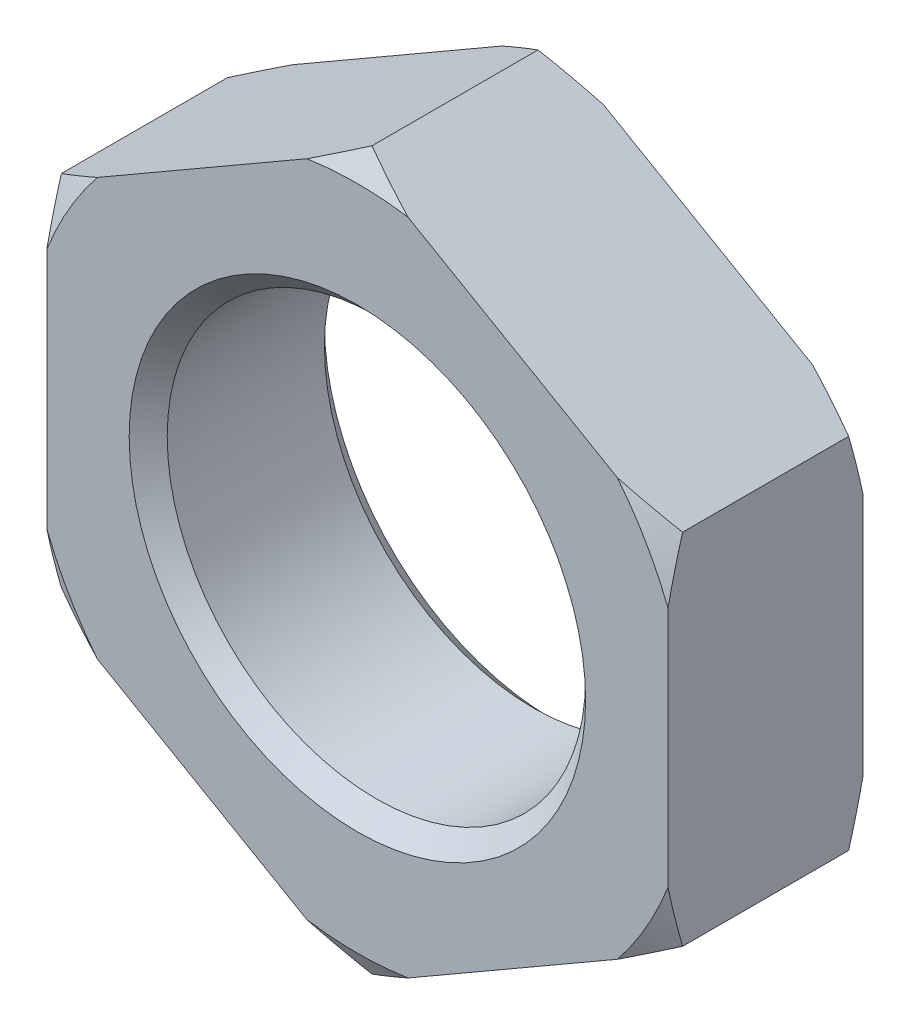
ISO-10303-21;
HEADER;
FILE_DESCRIPTION(('STEP AP214'),'2;1');
FILE_NAME('part.step','',(''),(''),'','','');
FILE_SCHEMA(('AUTOMOTIVE_DESIGN { 1 0 10303 214 1 1 1 1 }'));
ENDSEC;
DATA;
#1=APPLICATION_CONTEXT('core data for automotive mechanical design processes');
#2=APPLICATION_PROTOCOL_DEFINITION('international standard','automotive_design',2000,#1);
#3=PRODUCT_CONTEXT('',#1,'mechanical');
#4=PRODUCT('Part','Part','',(#3));
#5=PRODUCT_RELATED_PRODUCT_CATEGORY('part','',(#4));
#6=PRODUCT_DEFINITION_FORMATION('','',#4);
#7=PRODUCT_DEFINITION_CONTEXT('part definition',#1,'design');
#8=PRODUCT_DEFINITION('design','',#6,#7);
#9=PRODUCT_DEFINITION_SHAPE('','',#8);
#10=(LENGTH_UNIT() NAMED_UNIT(*) SI_UNIT(.MILLI.,.METRE.));
#11=(NAMED_UNIT(*) PLANE_ANGLE_UNIT() SI_UNIT($,.RADIAN.));
#12=(NAMED_UNIT(*) SI_UNIT($,.STERADIAN.) SOLID_ANGLE_UNIT());
#13=UNCERTAINTY_MEASURE_WITH_UNIT(LENGTH_MEASURE(1.E-05),#10,'distance_accuracy_value','');
#14=(GEOMETRIC_REPRESENTATION_CONTEXT(3) GLOBAL_UNCERTAINTY_ASSIGNED_CONTEXT((#13)) GLOBAL_UNIT_ASSIGNED_CONTEXT((#10,
#11,#12)) REPRESENTATION_CONTEXT('',''));
#15=CARTESIAN_POINT('',(0.,0.,0.));
#16=DIRECTION('',(0.,0.,1.));
#17=DIRECTION('',(1.,0.,0.));
#18=AXIS2_PLACEMENT_3D('',#15,#16,#17);
#19=CARTESIAN_POINT('',(0.,0.,-7.7));
#20=DIRECTION('',(0.,0.,1.));
#21=DIRECTION('',(1.,0.,0.));
#22=AXIS2_PLACEMENT_3D('',#19,#20,#21);
#23=PLANE('',#22);
#24=CARTESIAN_POINT('',(0.,0.,-7.7));
#25=DIRECTION('',(0.,0.,1.));
#26=DIRECTION('',(1.,0.,0.));
#27=AXIS2_PLACEMENT_3D('',#24,#25,#26);
#28=CIRCLE('',#27,18.);
#29=CARTESIAN_POINT('',(18.,0.,-7.7));
#30=VERTEX_POINT('',#29);
#31=EDGE_CURVE('E431',#30,#30,#28,.T.);
#32=ORIENTED_EDGE('',*,*,#31,.T.);
#33=EDGE_LOOP('',(#32));
#34=FACE_BOUND('',#33,.T.);
#35=DIRECTION('',(0.,1.,0.));
#36=VECTOR('',#35,1.);
#37=CARTESIAN_POINT('',(24.5,-14.1450815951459,-7.7));
#38=LINE('',#37,#36);
#39=CARTESIAN_POINT('',(24.5,-9.53533851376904,-7.7));
#40=VERTEX_POINT('',#39);
#41=CARTESIAN_POINT('',(24.5,9.53533851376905,-7.7));
#42=VERTEX_POINT('',#41);
#43=EDGE_CURVE('E363',#40,#42,#38,.T.);
#44=ORIENTED_EDGE('',*,*,#43,.F.);
#45=CARTESIAN_POINT('',(0.,0.,-7.7));
#46=DIRECTION('',(0.,0.,-1.));
#47=DIRECTION('',(-1.,0.,0.));
#48=AXIS2_PLACEMENT_3D('',#45,#46,#47);
#49=CIRCLE('',#48,26.2901631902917);
#50=CARTESIAN_POINT('',(20.5078453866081,-16.4499531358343,-7.7));
#51=VERTEX_POINT('',#50);
#52=EDGE_CURVE('E350',#40,#51,#49,.T.);
#53=ORIENTED_EDGE('',*,*,#52,.T.);
#54=DIRECTION('',(0.866025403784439,0.5,0.));
#55=VECTOR('',#54,1.);
#56=CARTESIAN_POINT('',(0.,-28.2901631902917,-7.7));
#57=LINE('',#56,#55);
#58=CARTESIAN_POINT('',(3.99215461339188,-25.9852916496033,-7.7));
#59=VERTEX_POINT('',#58);
#60=EDGE_CURVE('E374',#59,#51,#57,.T.);
#61=ORIENTED_EDGE('',*,*,#60,.F.);
#62=CARTESIAN_POINT('',(-3.99215461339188,-25.9852916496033,-7.7));
#63=VERTEX_POINT('',#62);
#64=EDGE_CURVE('E345',#59,#63,#49,.T.);
#65=ORIENTED_EDGE('',*,*,#64,.T.);
#66=DIRECTION('',(0.866025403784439,-0.5,0.));
#67=VECTOR('',#66,1.);
#68=CARTESIAN_POINT('',(-24.5,-14.1450815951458,-7.7));
#69=LINE('',#68,#67);
#70=CARTESIAN_POINT('',(-20.5078453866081,-16.4499531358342,-7.7));
#71=VERTEX_POINT('',#70);
#72=EDGE_CURVE('E382',#71,#63,#69,.T.);
#73=ORIENTED_EDGE('',*,*,#72,.F.);
#74=CARTESIAN_POINT('',(-24.5,-9.53533851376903,-7.7));
#75=VERTEX_POINT('',#74);
#76=EDGE_CURVE('E339',#71,#75,#49,.T.);
#77=ORIENTED_EDGE('',*,*,#76,.T.);
#78=DIRECTION('',(0.,-1.,0.));
#79=VECTOR('',#78,1.);
#80=CARTESIAN_POINT('',(-24.5,14.1450815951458,-7.7));
#81=LINE('',#80,#79);
#82=CARTESIAN_POINT('',(-24.5,9.53533851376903,-7.7));
#83=VERTEX_POINT('',#82);
#84=EDGE_CURVE('E481',#83,#75,#81,.T.);
#85=ORIENTED_EDGE('',*,*,#84,.F.);
#86=CARTESIAN_POINT('',(-20.5078453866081,16.4499531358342,-7.7));
#87=VERTEX_POINT('',#86);
#88=EDGE_CURVE('E63',#83,#87,#49,.T.);
#89=ORIENTED_EDGE('',*,*,#88,.T.);
#90=DIRECTION('',(-0.866025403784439,-0.5,0.));
#91=VECTOR('',#90,1.);
#92=CARTESIAN_POINT('',(0.,28.2901631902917,-7.7));
#93=LINE('',#92,#91);
#94=CARTESIAN_POINT('',(-3.99215461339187,25.9852916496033,-7.7));
#95=VERTEX_POINT('',#94);
#96=EDGE_CURVE('E181',#95,#87,#93,.T.);
#97=ORIENTED_EDGE('',*,*,#96,.F.);
#98=CARTESIAN_POINT('',(3.99215461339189,25.9852916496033,-7.7));
#99=VERTEX_POINT('',#98);
#100=EDGE_CURVE('E55',#95,#99,#49,.T.);
#101=ORIENTED_EDGE('',*,*,#100,.T.);
#102=DIRECTION('',(-0.866025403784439,0.5,0.));
#103=VECTOR('',#102,1.);
#104=CARTESIAN_POINT('',(24.5,14.1450815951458,-7.7));
#105=LINE('',#104,#103);
#106=CARTESIAN_POINT('',(20.5078453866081,16.4499531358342,-7.7));
#107=VERTEX_POINT('',#106);
#108=EDGE_CURVE('E364',#107,#99,#105,.T.);
#109=ORIENTED_EDGE('',*,*,#108,.F.);
#110=EDGE_CURVE('E342',#107,#42,#49,.T.);
#111=ORIENTED_EDGE('',*,*,#110,.T.);
#112=EDGE_LOOP('',(#44,#53,#61,#65,#73,#77,#85,#89,#97,#101,#109,#111));
#113=FACE_BOUND('',#112,.T.);
#114=ADVANCED_FACE('F39',(#34,#113),#23,.F.);
#115=CARTESIAN_POINT('',(0.,0.,7.7));
#116=DIRECTION('',(0.,0.,1.));
#117=DIRECTION('',(1.,0.,0.));
#118=AXIS2_PLACEMENT_3D('',#115,#116,#117);
#119=PLANE('',#118);
#120=CARTESIAN_POINT('',(0.,0.,7.7));
#121=DIRECTION('',(0.,0.,1.));
#122=DIRECTION('',(1.,0.,0.));
#123=AXIS2_PLACEMENT_3D('',#120,#121,#122);
#124=CIRCLE('',#123,18.);
#125=CARTESIAN_POINT('',(18.,0.,7.7));
#126=VERTEX_POINT('',#125);
#127=EDGE_CURVE('E11',#126,#126,#124,.F.);
#128=ORIENTED_EDGE('',*,*,#127,.T.);
#129=EDGE_LOOP('',(#128));
#130=FACE_BOUND('',#129,.T.);
#131=CARTESIAN_POINT('',(0.,0.,7.7));
#132=DIRECTION('',(0.,0.,-1.));
#133=DIRECTION('',(-1.,0.,0.));
#134=AXIS2_PLACEMENT_3D('',#131,#132,#133);
#135=CIRCLE('',#134,26.2901631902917);
#136=CARTESIAN_POINT('',(24.5,-9.53533851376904,7.7));
#137=VERTEX_POINT('',#136);
#138=CARTESIAN_POINT('',(20.5078453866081,-16.4499531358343,7.7));
#139=VERTEX_POINT('',#138);
#140=EDGE_CURVE('E314',#137,#139,#135,.T.);
#141=ORIENTED_EDGE('',*,*,#140,.F.);
#142=DIRECTION('',(0.,1.,0.));
#143=VECTOR('',#142,1.);
#144=CARTESIAN_POINT('',(24.5,-14.1450815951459,7.7));
#145=LINE('',#144,#143);
#146=CARTESIAN_POINT('',(24.5,9.53533851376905,7.7));
#147=VERTEX_POINT('',#146);
#148=EDGE_CURVE('E390',#137,#147,#145,.T.);
#149=ORIENTED_EDGE('',*,*,#148,.T.);
#150=CARTESIAN_POINT('',(20.5078453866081,16.4499531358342,7.7));
#151=VERTEX_POINT('',#150);
#152=EDGE_CURVE('E306',#151,#147,#135,.T.);
#153=ORIENTED_EDGE('',*,*,#152,.F.);
#154=DIRECTION('',(-0.866025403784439,0.5,0.));
#155=VECTOR('',#154,1.);
#156=CARTESIAN_POINT('',(24.5,14.1450815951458,7.7));
#157=LINE('',#156,#155);
#158=CARTESIAN_POINT('',(3.99215461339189,25.9852916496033,7.7));
#159=VERTEX_POINT('',#158);
#160=EDGE_CURVE('E373',#151,#159,#157,.T.);
#161=ORIENTED_EDGE('',*,*,#160,.T.);
#162=CARTESIAN_POINT('',(-3.99215461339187,25.9852916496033,7.7));
#163=VERTEX_POINT('',#162);
#164=EDGE_CURVE('E297',#163,#159,#135,.T.);
#165=ORIENTED_EDGE('',*,*,#164,.F.);
#166=DIRECTION('',(-0.866025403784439,-0.5,0.));
#167=VECTOR('',#166,1.);
#168=CARTESIAN_POINT('',(0.,28.2901631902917,7.7));
#169=LINE('',#168,#167);
#170=CARTESIAN_POINT('',(-20.5078453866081,16.4499531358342,7.7));
#171=VERTEX_POINT('',#170);
#172=EDGE_CURVE('E380',#163,#171,#169,.T.);
#173=ORIENTED_EDGE('',*,*,#172,.T.);
#174=CARTESIAN_POINT('',(-24.5,9.53533851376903,7.7));
#175=VERTEX_POINT('',#174);
#176=EDGE_CURVE('E295',#175,#171,#135,.T.);
#177=ORIENTED_EDGE('',*,*,#176,.F.);
#178=DIRECTION('',(0.,-1.,0.));
#179=VECTOR('',#178,1.);
#180=CARTESIAN_POINT('',(-24.5,14.1450815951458,7.7));
#181=LINE('',#180,#179);
#182=CARTESIAN_POINT('',(-24.5,-9.53533851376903,7.7));
#183=VERTEX_POINT('',#182);
#184=EDGE_CURVE('E493',#175,#183,#181,.T.);
#185=ORIENTED_EDGE('',*,*,#184,.T.);
#186=CARTESIAN_POINT('',(-20.5078453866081,-16.4499531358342,7.7));
#187=VERTEX_POINT('',#186);
#188=EDGE_CURVE('E298',#187,#183,#135,.T.);
#189=ORIENTED_EDGE('',*,*,#188,.F.);
#190=DIRECTION('',(0.866025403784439,-0.5,0.));
#191=VECTOR('',#190,1.);
#192=CARTESIAN_POINT('',(-24.5,-14.1450815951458,7.7));
#193=LINE('',#192,#191);
#194=CARTESIAN_POINT('',(-3.99215461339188,-25.9852916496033,7.7));
#195=VERTEX_POINT('',#194);
#196=EDGE_CURVE('E472',#187,#195,#193,.T.);
#197=ORIENTED_EDGE('',*,*,#196,.T.);
#198=CARTESIAN_POINT('',(3.99215461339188,-25.9852916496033,7.7));
#199=VERTEX_POINT('',#198);
#200=EDGE_CURVE('E308',#199,#195,#135,.T.);
#201=ORIENTED_EDGE('',*,*,#200,.F.);
#202=DIRECTION('',(0.866025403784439,0.5,0.));
#203=VECTOR('',#202,1.);
#204=CARTESIAN_POINT('',(0.,-28.2901631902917,7.7));
#205=LINE('',#204,#203);
#206=EDGE_CURVE('E469',#199,#139,#205,.T.);
#207=ORIENTED_EDGE('',*,*,#206,.T.);
#208=EDGE_LOOP('',(#141,#149,#153,#161,#165,#173,#177,#185,#189,#197,#201,#207));
#209=FACE_BOUND('',#208,.T.);
#210=ADVANCED_FACE('F422',(#130,#209),#119,.T.);
#211=CARTESIAN_POINT('',(24.5,14.1450815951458,7.7));
#212=DIRECTION('',(-0.5,-0.866025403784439,0.));
#213=DIRECTION('',(0.866025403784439,-0.5,0.));
#214=AXIS2_PLACEMENT_3D('',#211,#212,#213);
#215=PLANE('',#214);
#216=DIRECTION('',(0.,0.,-1.));
#217=VECTOR('',#216,1.);
#218=CARTESIAN_POINT('',(24.5,14.1450815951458,7.7));
#219=LINE('',#218,#217);
#220=CARTESIAN_POINT('',(24.5,14.1450815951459,6.54529946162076));
#221=VERTEX_POINT('',#220);
#222=CARTESIAN_POINT('',(24.5,14.1450815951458,-6.54529946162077));
#223=VERTEX_POINT('',#222);
#224=EDGE_CURVE('E386',#221,#223,#219,.T.);
#225=ORIENTED_EDGE('',*,*,#224,.T.);
#226=CARTESIAN_POINT('',(41.4884312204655,4.33680625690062,1.20523326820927));
#227=CARTESIAN_POINT('',(41.1036261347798,4.55897357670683,0.997608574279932));
#228=CARTESIAN_POINT('',(40.7183541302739,4.78141047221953,0.791138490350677));
#229=CARTESIAN_POINT('',(39.9467944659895,5.22687065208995,0.380733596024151));
#230=CARTESIAN_POINT('',(39.5605067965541,5.44989394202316,0.176798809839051));
#231=CARTESIAN_POINT('',(38.3999181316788,6.11996012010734,-0.430904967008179));
#232=CARTESIAN_POINT('',(37.6239814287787,6.56794738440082,-0.83052471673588));
#233=CARTESIAN_POINT('',(36.0645511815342,7.46828485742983,-1.6177131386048));
#234=CARTESIAN_POINT('',(35.2810413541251,7.92064446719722,-2.00523888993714));
#235=CARTESIAN_POINT('',(33.7081453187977,8.82875641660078,-2.76401907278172));
#236=CARTESIAN_POINT('',(32.9187592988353,9.28450864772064,-3.13527402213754));
#237=CARTESIAN_POINT('',(31.3130919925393,10.2115410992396,-3.86709346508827));
#238=CARTESIAN_POINT('',(30.4966359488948,10.6829222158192,-4.22714891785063));
#239=CARTESIAN_POINT('',(28.8554744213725,11.6304472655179,-4.92155909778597));
#240=CARTESIAN_POINT('',(28.0307685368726,12.1065914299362,-5.25591256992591));
#241=CARTESIAN_POINT('',(26.3729580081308,13.0637287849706,-5.8925367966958));
#242=CARTESIAN_POINT('',(25.5398623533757,13.5447167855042,-6.19483856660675));
#243=CARTESIAN_POINT('',(23.8637766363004,14.5124053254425,-6.76038620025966));
#244=CARTESIAN_POINT('',(23.0207878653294,14.9991051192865,-7.02363710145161));
#245=CARTESIAN_POINT('',(21.5887459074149,15.8258949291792,-7.42806645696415));
#246=CARTESIAN_POINT('',(21.0023380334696,16.1644576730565,-7.58173450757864));
#247=CARTESIAN_POINT('',(19.8249243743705,16.8442377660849,-7.86360092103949));
#248=CARTESIAN_POINT('',(19.2339186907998,17.185455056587,-7.99179984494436));
#249=CARTESIAN_POINT('',(18.0479457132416,17.8701768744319,-8.21982453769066));
#250=CARTESIAN_POINT('',(17.4529794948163,18.2136807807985,-8.31965771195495));
#251=CARTESIAN_POINT('',(16.2597444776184,18.9025953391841,-8.48842417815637));
#252=CARTESIAN_POINT('',(15.6614757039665,19.2480059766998,-8.55735770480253));
#253=CARTESIAN_POINT('',(14.4697018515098,19.9360769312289,-8.66174542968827));
#254=CARTESIAN_POINT('',(13.8762218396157,20.2787227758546,-8.69757809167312));
#255=CARTESIAN_POINT('',(12.6884575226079,20.9644788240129,-8.73605856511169));
#256=CARTESIAN_POINT('',(12.0941732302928,21.3075890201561,-8.73870689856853));
#257=CARTESIAN_POINT('',(10.9061625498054,21.9934873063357,-8.71073493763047));
#258=CARTESIAN_POINT('',(10.3124361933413,22.3362753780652,-8.68011285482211));
#259=CARTESIAN_POINT('',(9.12690226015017,23.0207437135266,-8.5865281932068));
#260=CARTESIAN_POINT('',(8.53509476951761,23.3624239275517,-8.52356418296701));
#261=CARTESIAN_POINT('',(7.13611090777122,24.1701276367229,-8.33808797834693));
#262=CARTESIAN_POINT('',(6.33025800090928,24.6353870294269,-8.20216322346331));
#263=CARTESIAN_POINT('',(4.72626891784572,25.5614505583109,-7.87924634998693));
#264=CARTESIAN_POINT('',(3.92813405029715,26.0222539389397,-7.69224572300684));
#265=CARTESIAN_POINT('',(2.3397844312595,26.9392880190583,-7.27426515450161));
#266=CARTESIAN_POINT('',(1.54957856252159,27.3955135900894,-7.04324066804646));
#267=CARTESIAN_POINT('',(-0.0219813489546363,28.3028541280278,-6.54446519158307));
#268=CARTESIAN_POINT('',(-0.803335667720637,28.7539692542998,-6.27671535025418));
#269=CARTESIAN_POINT('',(-2.36670043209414,29.6565783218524,-5.70757722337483));
#270=CARTESIAN_POINT('',(-3.14861360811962,30.1080161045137,-5.40583516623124));
#271=CARTESIAN_POINT('',(-4.70467893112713,31.0064108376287,-4.77687311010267));
#272=CARTESIAN_POINT('',(-5.47883101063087,31.4533677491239,-4.44965288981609));
#273=CARTESIAN_POINT('',(-7.01983775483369,32.3430684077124,-3.77450737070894));
#274=CARTESIAN_POINT('',(-7.78669603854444,32.7858142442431,-3.4265930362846));
#275=CARTESIAN_POINT('',(-9.31437454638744,33.6678198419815,-2.71362193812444));
#276=CARTESIAN_POINT('',(-10.0751949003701,34.1070796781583,-2.34856554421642));
#277=CARTESIAN_POINT('',(-11.3533295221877,34.8450110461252,-1.72122177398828));
#278=CARTESIAN_POINT('',(-11.8720321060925,35.1444841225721,-1.46268974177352));
#279=CARTESIAN_POINT('',(-12.9071912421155,35.742133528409,-0.939751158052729));
#280=CARTESIAN_POINT('',(-13.4236478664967,36.0403098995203,-0.675344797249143));
#281=CARTESIAN_POINT('',(-14.4491693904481,36.6323950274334,-0.144126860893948));
#282=CARTESIAN_POINT('',(-14.9582552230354,36.9263158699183,0.122630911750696));
#283=CARTESIAN_POINT('',(-15.9746401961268,37.5131260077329,0.660675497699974));
#284=CARTESIAN_POINT('',(-16.4819393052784,37.8060152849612,0.931962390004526));
#285=CARTESIAN_POINT('',(-16.9884312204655,38.0984385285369,1.20523326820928));
#286=B_SPLINE_CURVE_WITH_KNOTS('',3,(#226,#227,#228,#229,#230,#231,#232,#233,#234,#235,#236,
#237,#238,#239,#240,#241,#242,#243,#244,#245,#246,#247,#248,#249,#250,#251,#252,#253,#254,#255,
#256,#257,#258,#259,#260,#261,#262,#263,#264,#265,#266,#267,#268,#269,#270,#271,#272,#273,#274,
#275,#276,#277,#278,#279,#280,#281,#282,#283,#284,#285),.UNSPECIFIED.,.F.,.F.,(4,2,2,2,2,2,2,2,
2,2,2,2,2,2,2,2,2,2,2,2,2,2,2,2,2,2,2,2,2,4),(0.,1.47134716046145,2.94270836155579,
5.88577483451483,8.83831253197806,11.7907561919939,14.8179903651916,17.8453722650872,
20.8697974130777,23.893832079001,25.9764471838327,28.0590164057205,30.141041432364,
32.2230506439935,34.2809490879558,36.3388151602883,38.3967918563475,40.4548596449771,
43.2743339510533,46.0942782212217,48.9170911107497,51.7398157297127,54.5952421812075,
57.4506934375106,60.3046450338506,63.1585350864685,65.1155885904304,67.0725786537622,
69.0091689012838,70.9457929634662),.UNSPECIFIED.);
#287=EDGE_CURVE('E318',#223,#107,#286,.T.);
#288=ORIENTED_EDGE('',*,*,#287,.T.);
#289=ORIENTED_EDGE('',*,*,#108,.T.);
#290=CARTESIAN_POINT('',(0.,28.2901631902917,-6.54529946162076));
#291=VERTEX_POINT('',#290);
#292=EDGE_CURVE('E309',#99,#291,#286,.T.);
#293=ORIENTED_EDGE('',*,*,#292,.T.);
#294=DIRECTION('',(0.,0.,-1.));
#295=VECTOR('',#294,1.);
#296=CARTESIAN_POINT('',(0.,28.2901631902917,7.7));
#297=LINE('',#296,#295);
#298=CARTESIAN_POINT('',(0.,28.2901631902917,6.54529946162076));
#299=VERTEX_POINT('',#298);
#300=EDGE_CURVE('E190',#299,#291,#297,.T.);
#301=ORIENTED_EDGE('',*,*,#300,.F.);
#302=CARTESIAN_POINT('',(-16.9884312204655,38.0984385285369,-1.20523326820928));
#303=CARTESIAN_POINT('',(-16.6036261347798,37.8762712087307,-0.997608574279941));
#304=CARTESIAN_POINT('',(-16.2183541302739,37.653834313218,-0.791138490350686));
#305=CARTESIAN_POINT('',(-15.4467944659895,37.2083741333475,-0.380733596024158));
#306=CARTESIAN_POINT('',(-15.0605067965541,36.9853508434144,-0.176798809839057));
#307=CARTESIAN_POINT('',(-13.8999181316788,36.3152846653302,0.430904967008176));
#308=CARTESIAN_POINT('',(-13.1239814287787,35.8672974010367,0.830524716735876));
#309=CARTESIAN_POINT('',(-11.5645511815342,34.9669599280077,1.61771313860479));
#310=CARTESIAN_POINT('',(-10.7810413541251,34.5146003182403,2.00523888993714));
#311=CARTESIAN_POINT('',(-9.20814531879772,33.6064883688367,2.76401907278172));
#312=CARTESIAN_POINT('',(-8.41875929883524,33.1507361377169,3.13527402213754));
#313=CARTESIAN_POINT('',(-6.81309199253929,32.2237036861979,3.86709346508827));
#314=CARTESIAN_POINT('',(-5.99663594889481,31.7523225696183,4.22714891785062));
#315=CARTESIAN_POINT('',(-4.35547442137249,30.8047975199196,4.92155909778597));
#316=CARTESIAN_POINT('',(-3.5307685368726,30.3286533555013,5.25591256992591));
#317=CARTESIAN_POINT('',(-1.87295800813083,29.3715160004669,5.8925367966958));
#318=CARTESIAN_POINT('',(-1.03986235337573,28.8905279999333,6.19483856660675));
#319=CARTESIAN_POINT('',(0.636223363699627,27.922839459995,6.76038620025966));
#320=CARTESIAN_POINT('',(1.47921213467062,27.436139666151,7.02363710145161));
#321=CARTESIAN_POINT('',(2.91125409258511,26.6093498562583,7.42806645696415));
#322=CARTESIAN_POINT('',(3.49766196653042,26.270787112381,7.58173450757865));
#323=CARTESIAN_POINT('',(4.67507562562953,25.5910070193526,7.8636009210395));
#324=CARTESIAN_POINT('',(5.26608130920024,25.2497897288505,7.99179984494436));
#325=CARTESIAN_POINT('',(6.4520542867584,24.5650679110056,8.21982453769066));
#326=CARTESIAN_POINT('',(7.04702050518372,24.221564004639,8.31965771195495));
#327=CARTESIAN_POINT('',(8.24025552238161,23.5326494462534,8.48842417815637));
#328=CARTESIAN_POINT('',(8.83852429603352,23.1872388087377,8.55735770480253));
#329=CARTESIAN_POINT('',(10.0302981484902,22.4991678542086,8.66174542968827));
#330=CARTESIAN_POINT('',(10.6237781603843,22.1565220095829,8.69757809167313));
#331=CARTESIAN_POINT('',(11.8115424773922,21.4707659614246,8.73605856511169));
#332=CARTESIAN_POINT('',(12.4058267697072,21.1276557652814,8.73870689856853));
#333=CARTESIAN_POINT('',(13.5938374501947,20.4417574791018,8.71073493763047));
#334=CARTESIAN_POINT('',(14.1875638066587,20.0989694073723,8.68011285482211));
#335=CARTESIAN_POINT('',(15.3730977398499,19.4145010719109,8.5865281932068));
#336=CARTESIAN_POINT('',(15.9649052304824,19.0728208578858,8.52356418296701));
#337=CARTESIAN_POINT('',(17.3638890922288,18.2651171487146,8.33808797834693));
#338=CARTESIAN_POINT('',(18.1697419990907,17.7998577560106,8.20216322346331));
#339=CARTESIAN_POINT('',(19.7737310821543,16.8737942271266,7.87924634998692));
#340=CARTESIAN_POINT('',(20.5718659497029,16.4129908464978,7.69224572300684));
#341=CARTESIAN_POINT('',(22.1602155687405,15.4959567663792,7.27426515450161));
#342=CARTESIAN_POINT('',(22.9504214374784,15.0397311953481,7.04324066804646));
#343=CARTESIAN_POINT('',(24.5219813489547,14.1323906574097,6.54446519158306));
#344=CARTESIAN_POINT('',(25.3033356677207,13.6812755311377,6.27671535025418));
#345=CARTESIAN_POINT('',(26.8667004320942,12.7786664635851,5.70757722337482));
#346=CARTESIAN_POINT('',(27.6486136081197,12.3272286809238,5.40583516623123));
#347=CARTESIAN_POINT('',(29.2046789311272,11.4288339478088,4.77687311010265));
#348=CARTESIAN_POINT('',(29.9788310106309,10.9818770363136,4.44965288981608));
#349=CARTESIAN_POINT('',(31.5198377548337,10.0921763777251,3.77450737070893));
#350=CARTESIAN_POINT('',(32.2866960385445,9.64943054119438,3.42659303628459));
#351=CARTESIAN_POINT('',(33.8143745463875,8.76742494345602,2.71362193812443));
#352=CARTESIAN_POINT('',(34.5751949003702,8.32816510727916,2.3485655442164));
#353=CARTESIAN_POINT('',(35.8533295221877,7.59023373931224,1.72122177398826));
#354=CARTESIAN_POINT('',(36.3720321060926,7.29076066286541,1.4626897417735));
#355=CARTESIAN_POINT('',(37.4071912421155,6.69311125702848,0.939751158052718));
#356=CARTESIAN_POINT('',(37.9236478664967,6.39493488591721,0.675344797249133));
#357=CARTESIAN_POINT('',(38.9491693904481,5.80284975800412,0.144126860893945));
#358=CARTESIAN_POINT('',(39.4582552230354,5.5089289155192,-0.122630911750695));
#359=CARTESIAN_POINT('',(40.4746401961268,4.9221187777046,-0.660675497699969));
#360=CARTESIAN_POINT('',(40.9819393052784,4.6292295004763,-0.931962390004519));
#361=CARTESIAN_POINT('',(41.4884312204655,4.33680625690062,-1.20523326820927));
#362=B_SPLINE_CURVE_WITH_KNOTS('',3,(#302,#303,#304,#305,#306,#307,#308,#309,#310,#311,#312,
#313,#314,#315,#316,#317,#318,#319,#320,#321,#322,#323,#324,#325,#326,#327,#328,#329,#330,#331,
#332,#333,#334,#335,#336,#337,#338,#339,#340,#341,#342,#343,#344,#345,#346,#347,#348,#349,#350,
#351,#352,#353,#354,#355,#356,#357,#358,#359,#360,#361),.UNSPECIFIED.,.F.,.F.,(4,2,2,2,2,2,2,2,
2,2,2,2,2,2,2,2,2,2,2,2,2,2,2,2,2,2,2,2,2,4),(0.,1.47134716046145,2.9427083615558,
5.88577483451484,8.83831253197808,11.7907561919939,14.8179903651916,17.8453722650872,
20.8697974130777,23.893832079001,25.9764471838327,28.0590164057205,30.141041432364,
32.2230506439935,34.2809490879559,36.3388151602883,38.3967918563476,40.4548596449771,
43.2743339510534,46.0942782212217,48.9170911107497,51.7398157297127,54.5952421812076,
57.4506934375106,60.3046450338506,63.1585350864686,65.1155885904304,67.0725786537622,
69.0091689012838,70.9457929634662),.UNSPECIFIED.);
#363=EDGE_CURVE('E478',#299,#159,#362,.T.);
#364=ORIENTED_EDGE('',*,*,#363,.T.);
#365=ORIENTED_EDGE('',*,*,#160,.F.);
#366=EDGE_CURVE('E248',#151,#221,#362,.T.);
#367=ORIENTED_EDGE('',*,*,#366,.T.);
#368=EDGE_LOOP('',(#225,#288,#289,#293,#301,#364,#365,#367));
#369=FACE_BOUND('',#368,.T.);
#370=ADVANCED_FACE('F427',(#369),#215,.F.);
#371=CARTESIAN_POINT('',(0.,28.2901631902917,7.7));
#372=DIRECTION('',(0.5,-0.866025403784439,0.));
#373=DIRECTION('',(0.866025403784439,0.5,0.));
#374=AXIS2_PLACEMENT_3D('',#371,#372,#373);
#375=PLANE('',#374);
#376=ORIENTED_EDGE('',*,*,#300,.T.);
#377=CARTESIAN_POINT('',(16.9884312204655,38.0984385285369,1.20523326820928));
#378=CARTESIAN_POINT('',(16.6036261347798,37.8762712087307,0.99760857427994));
#379=CARTESIAN_POINT('',(16.2183541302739,37.653834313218,0.791138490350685));
#380=CARTESIAN_POINT('',(15.4467944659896,37.2083741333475,0.38073359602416));
#381=CARTESIAN_POINT('',(15.0605067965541,36.9853508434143,0.17679880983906));
#382=CARTESIAN_POINT('',(13.8999181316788,36.3152846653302,-0.430904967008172));
#383=CARTESIAN_POINT('',(13.1239814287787,35.8672974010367,-0.830524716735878));
#384=CARTESIAN_POINT('',(11.5645511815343,34.9669599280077,-1.61771313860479));
#385=CARTESIAN_POINT('',(10.7810413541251,34.5146003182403,-2.00523888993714));
#386=CARTESIAN_POINT('',(9.20814531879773,33.6064883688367,-2.76401907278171));
#387=CARTESIAN_POINT('',(8.41875929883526,33.1507361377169,-3.13527402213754));
#388=CARTESIAN_POINT('',(6.8130919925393,32.2237036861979,-3.86709346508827));
#389=CARTESIAN_POINT('',(5.99663594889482,31.7523225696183,-4.22714891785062));
#390=CARTESIAN_POINT('',(4.35547442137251,30.8047975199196,-4.92155909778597));
#391=CARTESIAN_POINT('',(3.53076853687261,30.3286533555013,-5.25591256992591));
#392=CARTESIAN_POINT('',(1.87295800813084,29.3715160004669,-5.8925367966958));
#393=CARTESIAN_POINT('',(1.03986235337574,28.8905279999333,-6.19483856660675));
#394=CARTESIAN_POINT('',(-0.636223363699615,27.922839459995,-6.76038620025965));
#395=CARTESIAN_POINT('',(-1.47921213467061,27.436139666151,-7.02363710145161));
#396=CARTESIAN_POINT('',(-2.9112540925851,26.6093498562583,-7.42806645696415));
#397=CARTESIAN_POINT('',(-3.4976619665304,26.270787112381,-7.58173450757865));
#398=CARTESIAN_POINT('',(-4.67507562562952,25.5910070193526,-7.8636009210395));
#399=CARTESIAN_POINT('',(-5.26608130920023,25.2497897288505,-7.99179984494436));
#400=CARTESIAN_POINT('',(-6.45205428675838,24.5650679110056,-8.21982453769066));
#401=CARTESIAN_POINT('',(-7.0470205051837,24.221564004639,-8.31965771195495));
#402=CARTESIAN_POINT('',(-8.24025552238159,23.5326494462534,-8.48842417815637));
#403=CARTESIAN_POINT('',(-8.83852429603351,23.1872388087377,-8.55735770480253));
#404=CARTESIAN_POINT('',(-10.0302981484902,22.4991678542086,-8.66174542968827));
#405=CARTESIAN_POINT('',(-10.6237781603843,22.1565220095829,-8.69757809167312));
#406=CARTESIAN_POINT('',(-11.8115424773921,21.4707659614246,-8.73605856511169));
#407=CARTESIAN_POINT('',(-12.4058267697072,21.1276557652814,-8.73870689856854));
#408=CARTESIAN_POINT('',(-13.5938374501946,20.4417574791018,-8.71073493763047));
#409=CARTESIAN_POINT('',(-14.1875638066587,20.0989694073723,-8.68011285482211));
#410=CARTESIAN_POINT('',(-15.3730977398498,19.4145010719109,-8.5865281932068));
#411=CARTESIAN_POINT('',(-15.9649052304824,19.0728208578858,-8.52356418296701));
#412=CARTESIAN_POINT('',(-17.3638890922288,18.2651171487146,-8.33808797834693));
#413=CARTESIAN_POINT('',(-18.1697419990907,17.7998577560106,-8.20216322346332));
#414=CARTESIAN_POINT('',(-19.7737310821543,16.8737942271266,-7.87924634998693));
#415=CARTESIAN_POINT('',(-20.5718659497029,16.4129908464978,-7.69224572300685));
#416=CARTESIAN_POINT('',(-22.1602155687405,15.4959567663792,-7.27426515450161));
#417=CARTESIAN_POINT('',(-22.9504214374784,15.0397311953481,-7.04324066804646));
#418=CARTESIAN_POINT('',(-24.5219813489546,14.1323906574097,-6.54446519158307));
#419=CARTESIAN_POINT('',(-25.3033356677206,13.6812755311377,-6.27671535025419));
#420=CARTESIAN_POINT('',(-26.8667004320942,12.7786664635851,-5.70757722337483));
#421=CARTESIAN_POINT('',(-27.6486136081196,12.3272286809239,-5.40583516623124));
#422=CARTESIAN_POINT('',(-29.2046789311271,11.4288339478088,-4.77687311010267));
#423=CARTESIAN_POINT('',(-29.9788310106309,10.9818770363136,-4.44965288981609));
#424=CARTESIAN_POINT('',(-31.5198377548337,10.0921763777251,-3.77450737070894));
#425=CARTESIAN_POINT('',(-32.2866960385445,9.6494305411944,-3.4265930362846));
#426=CARTESIAN_POINT('',(-33.8143745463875,8.76742494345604,-2.71362193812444));
#427=CARTESIAN_POINT('',(-34.5751949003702,8.32816510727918,-2.34856554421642));
#428=CARTESIAN_POINT('',(-35.8533295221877,7.59023373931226,-1.72122177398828));
#429=CARTESIAN_POINT('',(-36.3720321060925,7.29076066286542,-1.46268974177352));
#430=CARTESIAN_POINT('',(-37.4071912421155,6.69311125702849,-0.939751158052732));
#431=CARTESIAN_POINT('',(-37.9236478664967,6.39493488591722,-0.675344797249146));
#432=CARTESIAN_POINT('',(-38.9491693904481,5.80284975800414,-0.144126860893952));
#433=CARTESIAN_POINT('',(-39.4582552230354,5.50892891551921,0.122630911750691));
#434=CARTESIAN_POINT('',(-40.4746401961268,4.9221187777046,0.660675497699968));
#435=CARTESIAN_POINT('',(-40.9819393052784,4.6292295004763,0.93196239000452));
#436=CARTESIAN_POINT('',(-41.4884312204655,4.33680625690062,1.20523326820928));
#437=B_SPLINE_CURVE_WITH_KNOTS('',3,(#377,#378,#379,#380,#381,#382,#383,#384,#385,#386,#387,
#388,#389,#390,#391,#392,#393,#394,#395,#396,#397,#398,#399,#400,#401,#402,#403,#404,#405,#406,
#407,#408,#409,#410,#411,#412,#413,#414,#415,#416,#417,#418,#419,#420,#421,#422,#423,#424,#425,
#426,#427,#428,#429,#430,#431,#432,#433,#434,#435,#436),.UNSPECIFIED.,.F.,.F.,(4,2,2,2,2,2,2,2,
2,2,2,2,2,2,2,2,2,2,2,2,2,2,2,2,2,2,2,2,2,4),(0.,1.47134716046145,2.9427083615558,
5.88577483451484,8.83831253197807,11.7907561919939,14.8179903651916,17.8453722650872,
20.8697974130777,23.893832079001,25.9764471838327,28.0590164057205,30.141041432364,
32.2230506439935,34.2809490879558,36.3388151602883,38.3967918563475,40.4548596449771,
43.2743339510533,46.0942782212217,48.9170911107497,51.7398157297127,54.5952421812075,
57.4506934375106,60.3046450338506,63.1585350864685,65.1155885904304,67.0725786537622,
69.0091689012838,70.9457929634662),.UNSPECIFIED.);
#438=EDGE_CURVE('E183',#291,#95,#437,.T.);
#439=ORIENTED_EDGE('',*,*,#438,.T.);
#440=ORIENTED_EDGE('',*,*,#96,.T.);
#441=CARTESIAN_POINT('',(-24.5,14.1450815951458,-6.54529946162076));
#442=VERTEX_POINT('',#441);
#443=EDGE_CURVE('E165',#87,#442,#437,.T.);
#444=ORIENTED_EDGE('',*,*,#443,.T.);
#445=DIRECTION('',(0.,0.,-1.));
#446=VECTOR('',#445,1.);
#447=CARTESIAN_POINT('',(-24.5,14.1450815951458,7.7));
#448=LINE('',#447,#446);
#449=CARTESIAN_POINT('',(-24.5,14.1450815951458,6.54529946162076));
#450=VERTEX_POINT('',#449);
#451=EDGE_CURVE('E179',#450,#442,#448,.T.);
#452=ORIENTED_EDGE('',*,*,#451,.F.);
#453=CARTESIAN_POINT('',(-41.4884312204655,4.33680625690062,-1.20523326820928));
#454=CARTESIAN_POINT('',(-41.1036261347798,4.55897357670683,-0.997608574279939));
#455=CARTESIAN_POINT('',(-40.7183541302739,4.78141047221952,-0.791138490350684));
#456=CARTESIAN_POINT('',(-39.9467944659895,5.22687065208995,-0.380733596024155));
#457=CARTESIAN_POINT('',(-39.5605067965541,5.44989394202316,-0.176798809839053));
#458=CARTESIAN_POINT('',(-38.3999181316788,6.11996012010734,0.430904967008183));
#459=CARTESIAN_POINT('',(-37.6239814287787,6.56794738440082,0.830524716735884));
#460=CARTESIAN_POINT('',(-36.0645511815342,7.46828485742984,1.6177131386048));
#461=CARTESIAN_POINT('',(-35.2810413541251,7.92064446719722,2.00523888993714));
#462=CARTESIAN_POINT('',(-33.7081453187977,8.82875641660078,2.76401907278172));
#463=CARTESIAN_POINT('',(-32.9187592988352,9.28450864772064,3.13527402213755));
#464=CARTESIAN_POINT('',(-31.3130919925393,10.2115410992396,3.86709346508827));
#465=CARTESIAN_POINT('',(-30.4966359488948,10.6829222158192,4.22714891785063));
#466=CARTESIAN_POINT('',(-28.8554744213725,11.6304472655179,4.92155909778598));
#467=CARTESIAN_POINT('',(-28.0307685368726,12.1065914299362,5.25591256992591));
#468=CARTESIAN_POINT('',(-26.3729580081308,13.0637287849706,5.89253679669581));
#469=CARTESIAN_POINT('',(-25.5398623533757,13.5447167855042,6.19483856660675));
#470=CARTESIAN_POINT('',(-23.8637766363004,14.5124053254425,6.76038620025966));
#471=CARTESIAN_POINT('',(-23.0207878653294,14.9991051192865,7.02363710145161));
#472=CARTESIAN_POINT('',(-21.5887459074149,15.8258949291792,7.42806645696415));
#473=CARTESIAN_POINT('',(-21.0023380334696,16.1644576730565,7.58173450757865));
#474=CARTESIAN_POINT('',(-19.8249243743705,16.8442377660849,7.8636009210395));
#475=CARTESIAN_POINT('',(-19.2339186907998,17.1854550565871,7.99179984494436));
#476=CARTESIAN_POINT('',(-18.0479457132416,17.8701768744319,8.21982453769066));
#477=CARTESIAN_POINT('',(-17.4529794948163,18.2136807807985,8.31965771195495));
#478=CARTESIAN_POINT('',(-16.2597444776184,18.9025953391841,8.48842417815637));
#479=CARTESIAN_POINT('',(-15.6614757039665,19.2480059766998,8.55735770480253));
#480=CARTESIAN_POINT('',(-14.4697018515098,19.9360769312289,8.66174542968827));
#481=CARTESIAN_POINT('',(-13.8762218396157,20.2787227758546,8.69757809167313));
#482=CARTESIAN_POINT('',(-12.6884575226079,20.9644788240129,8.73605856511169));
#483=CARTESIAN_POINT('',(-12.0941732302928,21.3075890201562,8.73870689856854));
#484=CARTESIAN_POINT('',(-10.9061625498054,21.9934873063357,8.71073493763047));
#485=CARTESIAN_POINT('',(-10.3124361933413,22.3362753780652,8.68011285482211));
#486=CARTESIAN_POINT('',(-9.12690226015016,23.0207437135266,8.5865281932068));
#487=CARTESIAN_POINT('',(-8.5350947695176,23.3624239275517,8.52356418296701));
#488=CARTESIAN_POINT('',(-7.13611090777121,24.1701276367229,8.33808797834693));
#489=CARTESIAN_POINT('',(-6.33025800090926,24.6353870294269,8.20216322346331));
#490=CARTESIAN_POINT('',(-4.72626891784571,25.5614505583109,7.87924634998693));
#491=CARTESIAN_POINT('',(-3.92813405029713,26.0222539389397,7.69224572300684));
#492=CARTESIAN_POINT('',(-2.33978443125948,26.9392880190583,7.27426515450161));
#493=CARTESIAN_POINT('',(-1.54957856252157,27.3955135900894,7.04324066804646));
#494=CARTESIAN_POINT('',(0.0219813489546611,28.3028541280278,6.54446519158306));
#495=CARTESIAN_POINT('',(0.803335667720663,28.7539692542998,6.27671535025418));
#496=CARTESIAN_POINT('',(2.36670043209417,29.6565783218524,5.70757722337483));
#497=CARTESIAN_POINT('',(3.14861360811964,30.1080161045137,5.40583516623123));
#498=CARTESIAN_POINT('',(4.70467893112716,31.0064108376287,4.77687311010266));
#499=CARTESIAN_POINT('',(5.4788310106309,31.4533677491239,4.44965288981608));
#500=CARTESIAN_POINT('',(7.01983775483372,32.3430684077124,3.77450737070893));
#501=CARTESIAN_POINT('',(7.78669603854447,32.7858142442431,3.4265930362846));
#502=CARTESIAN_POINT('',(9.31437454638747,33.6678198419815,2.71362193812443));
#503=CARTESIAN_POINT('',(10.0751949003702,34.1070796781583,2.34856554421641));
#504=CARTESIAN_POINT('',(11.3533295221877,34.8450110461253,1.72122177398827));
#505=CARTESIAN_POINT('',(11.8720321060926,35.1444841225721,1.46268974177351));
#506=CARTESIAN_POINT('',(12.9071912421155,35.742133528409,0.939751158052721));
#507=CARTESIAN_POINT('',(13.4236478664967,36.0403098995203,0.675344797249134));
#508=CARTESIAN_POINT('',(14.4491693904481,36.6323950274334,0.144126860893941));
#509=CARTESIAN_POINT('',(14.9582552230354,36.9263158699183,-0.122630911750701));
#510=CARTESIAN_POINT('',(15.9746401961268,37.5131260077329,-0.660675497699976));
#511=CARTESIAN_POINT('',(16.4819393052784,37.8060152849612,-0.931962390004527));
#512=CARTESIAN_POINT('',(16.9884312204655,38.0984385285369,-1.20523326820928));
#513=B_SPLINE_CURVE_WITH_KNOTS('',3,(#453,#454,#455,#456,#457,#458,#459,#460,#461,#462,#463,
#464,#465,#466,#467,#468,#469,#470,#471,#472,#473,#474,#475,#476,#477,#478,#479,#480,#481,#482,
#483,#484,#485,#486,#487,#488,#489,#490,#491,#492,#493,#494,#495,#496,#497,#498,#499,#500,#501,
#502,#503,#504,#505,#506,#507,#508,#509,#510,#511,#512),.UNSPECIFIED.,.F.,.F.,(4,2,2,2,2,2,2,2,
2,2,2,2,2,2,2,2,2,2,2,2,2,2,2,2,2,2,2,2,2,4),(0.,1.47134716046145,2.9427083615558,
5.88577483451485,8.83831253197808,11.7907561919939,14.8179903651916,17.8453722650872,
20.8697974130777,23.893832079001,25.9764471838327,28.0590164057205,30.141041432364,
32.2230506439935,34.2809490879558,36.3388151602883,38.3967918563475,40.4548596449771,
43.2743339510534,46.0942782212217,48.9170911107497,51.7398157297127,54.5952421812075,
57.4506934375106,60.3046450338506,63.1585350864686,65.1155885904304,67.0725786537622,
69.0091689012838,70.9457929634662),.UNSPECIFIED.);
#514=EDGE_CURVE('E268',#450,#171,#513,.T.);
#515=ORIENTED_EDGE('',*,*,#514,.T.);
#516=ORIENTED_EDGE('',*,*,#172,.F.);
#517=EDGE_CURVE('E488',#163,#299,#513,.T.);
#518=ORIENTED_EDGE('',*,*,#517,.T.);
#519=EDGE_LOOP('',(#376,#439,#440,#444,#452,#515,#516,#518));
#520=FACE_BOUND('',#519,.T.);
#521=ADVANCED_FACE('F177',(#520),#375,.F.);
#522=CARTESIAN_POINT('',(-24.5,14.1450815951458,7.7));
#523=DIRECTION('',(1.,0.,0.));
#524=DIRECTION('',(0.,0.,-1.));
#525=AXIS2_PLACEMENT_3D('',#522,#523,#524);
#526=PLANE('',#525);
#527=ORIENTED_EDGE('',*,*,#451,.T.);
#528=CARTESIAN_POINT('',(-24.5,31.1335128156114,-0.0054635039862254));
#529=CARTESIAN_POINT('',(-24.5,30.6910175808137,-0.206224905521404));
#530=CARTESIAN_POINT('',(-24.5,30.2479102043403,-0.405636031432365));
#531=CARTESIAN_POINT('',(-24.5,29.3603623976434,-0.801484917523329));
#532=CARTESIAN_POINT('',(-24.5,28.9159219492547,-0.997922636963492));
#533=CARTESIAN_POINT('',(-24.5,27.5803061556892,-1.58242384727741));
#534=CARTESIAN_POINT('',(-24.5,26.686985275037,-1.96560761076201));
#535=CARTESIAN_POINT('',(-24.5,24.8899844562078,-2.71780660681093));
#536=CARTESIAN_POINT('',(-24.5,23.9862768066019,-3.08675580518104));
#537=CARTESIAN_POINT('',(-24.5,22.1712154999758,-3.805297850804));
#538=CARTESIAN_POINT('',(-24.5,21.259862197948,-4.1548915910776));
#539=CARTESIAN_POINT('',(-24.5,19.4325327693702,-4.82887358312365));
#540=CARTESIAN_POINT('',(-24.5,18.516596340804,-5.15336893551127));
#541=CARTESIAN_POINT('',(-24.5,16.6749282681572,-5.77362531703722));
#542=CARTESIAN_POINT('',(-24.5,15.7491961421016,-6.06938492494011));
#543=CARTESIAN_POINT('',(-24.5,13.8883822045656,-6.62538404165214));
#544=CARTESIAN_POINT('',(-24.5,12.9533143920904,-6.88567005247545));
#545=CARTESIAN_POINT('',(-24.5,11.0723625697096,-7.36374914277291));
#546=CARTESIAN_POINT('',(-24.5,10.126480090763,-7.58154815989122));
#547=CARTESIAN_POINT('',(-24.5,8.4933515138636,-7.91223722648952));
#548=CARTESIAN_POINT('',(-24.5,7.80858503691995,-8.03737857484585));
#549=CARTESIAN_POINT('',(-24.5,6.43438071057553,-8.25882755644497));
#550=CARTESIAN_POINT('',(-24.5,5.74494300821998,-8.35513609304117));
#551=CARTESIAN_POINT('',(-24.5,4.36255458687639,-8.51636883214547));
#552=CARTESIAN_POINT('',(-24.5,3.66960479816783,-8.58130094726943));
#553=CARTESIAN_POINT('',(-24.5,2.28137087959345,-8.67792897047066));
#554=CARTESIAN_POINT('',(-24.5,1.58608675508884,-8.70962495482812));
#555=CARTESIAN_POINT('',(-24.5,0.195141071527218,-8.73879176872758));
#556=CARTESIAN_POINT('',(-24.5,-0.500520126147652,-8.73627966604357));
#557=CARTESIAN_POINT('',(-24.5,-1.89086922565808,-8.69715177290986));
#558=CARTESIAN_POINT('',(-24.5,-2.58555713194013,-8.66053613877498));
#559=CARTESIAN_POINT('',(-24.5,-3.97246163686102,-8.5543188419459));
#560=CARTESIAN_POINT('',(-24.5,-4.66467796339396,-8.48471365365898));
#561=CARTESIAN_POINT('',(-24.5,-6.04527152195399,-8.31451898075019));
#562=CARTESIAN_POINT('',(-24.5,-6.73364859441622,-8.21392821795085));
#563=CARTESIAN_POINT('',(-24.5,-8.44619843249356,-7.92734053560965));
#564=CARTESIAN_POINT('',(-24.5,-9.46743771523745,-7.72373476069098));
#565=CARTESIAN_POINT('',(-24.5,-11.4976869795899,-7.26267636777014));
#566=CARTESIAN_POINT('',(-24.5,-12.5066942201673,-7.00521190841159));
#567=CARTESIAN_POINT('',(-24.5,-14.5144664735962,-6.44548509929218));
#568=CARTESIAN_POINT('',(-24.5,-15.5132042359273,-6.14312593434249));
#569=CARTESIAN_POINT('',(-24.5,-17.4989347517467,-5.50255159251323));
#570=CARTESIAN_POINT('',(-24.5,-18.485928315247,-5.1643389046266));
#571=CARTESIAN_POINT('',(-24.5,-20.4606008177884,-4.45507922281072));
#572=CARTESIAN_POINT('',(-24.5,-21.448161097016,-4.08370395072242));
#573=CARTESIAN_POINT('',(-24.5,-23.4140717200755,-3.3172499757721));
#574=CARTESIAN_POINT('',(-24.5,-24.3924214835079,-2.92216979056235));
#575=CARTESIAN_POINT('',(-24.5,-25.8509509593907,-2.31645933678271));
#576=CARTESIAN_POINT('',(-24.5,-26.3341405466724,-2.11302641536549));
#577=CARTESIAN_POINT('',(-24.5,-27.2987036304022,-1.70188995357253));
#578=CARTESIAN_POINT('',(-24.5,-27.7800771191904,-1.49418639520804));
#579=CARTESIAN_POINT('',(-24.5,-28.7410269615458,-1.0749820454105));
#580=CARTESIAN_POINT('',(-24.5,-29.2206037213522,-0.86348218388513));
#581=CARTESIAN_POINT('',(-24.5,-30.1781955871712,-0.436997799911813));
#582=CARTESIAN_POINT('',(-24.5,-30.656210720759,-0.22201333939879));
#583=CARTESIAN_POINT('',(-24.5,-31.1335128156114,-0.0054635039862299));
#584=B_SPLINE_CURVE_WITH_KNOTS('',3,(#528,#529,#530,#531,#532,#533,#534,#535,#536,#537,#538,
#539,#540,#541,#542,#543,#544,#545,#546,#547,#548,#549,#550,#551,#552,#553,#554,#555,#556,#557,
#558,#559,#560,#561,#562,#563,#564,#565,#566,#567,#568,#569,#570,#571,#572,#573,#574,#575,#576,
#577,#578,#579,#580,#581,#582,#583),.UNSPECIFIED.,.F.,.F.,(4,2,2,2,2,2,2,2,2,2,2,2,2,2,2,2,2,2,
2,2,2,2,2,2,2,2,2,4),(0.,1.45772158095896,2.91546311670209,5.83143698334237,8.75961885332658,
11.6876655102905,14.6024356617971,17.5173499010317,20.4284054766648,23.3390539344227,
25.4268423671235,27.5145653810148,29.6017616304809,31.6889530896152,33.7751032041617,
35.8612437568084,37.9476073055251,40.034056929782,43.1562047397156,46.2790397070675,
49.4087095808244,52.5381623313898,55.7030321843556,58.8681001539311,60.4408891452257,
62.0136847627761,63.5861002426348,65.158487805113),.UNSPECIFIED.);
#585=EDGE_CURVE('E162',#442,#83,#584,.T.);
#586=ORIENTED_EDGE('',*,*,#585,.T.);
#587=ORIENTED_EDGE('',*,*,#84,.T.);
#588=CARTESIAN_POINT('',(-24.5,-14.1450815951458,-6.54529946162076));
#589=VERTEX_POINT('',#588);
#590=EDGE_CURVE('E171',#75,#589,#584,.T.);
#591=ORIENTED_EDGE('',*,*,#590,.T.);
#592=DIRECTION('',(0.,0.,-1.));
#593=VECTOR('',#592,1.);
#594=CARTESIAN_POINT('',(-24.5,-14.1450815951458,7.7));
#595=LINE('',#594,#593);
#596=CARTESIAN_POINT('',(-24.5,-14.1450815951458,6.54529946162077));
#597=VERTEX_POINT('',#596);
#598=EDGE_CURVE('E191',#597,#589,#595,.T.);
#599=ORIENTED_EDGE('',*,*,#598,.F.);
#600=CARTESIAN_POINT('',(-24.5,-31.1335128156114,0.00546350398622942));
#601=CARTESIAN_POINT('',(-24.5,-30.6910175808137,0.206224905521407));
#602=CARTESIAN_POINT('',(-24.5,-30.2479102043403,0.405636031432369));
#603=CARTESIAN_POINT('',(-24.5,-29.3603623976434,0.801484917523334));
#604=CARTESIAN_POINT('',(-24.5,-28.9159219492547,0.997922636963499));
#605=CARTESIAN_POINT('',(-24.5,-27.5803061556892,1.58242384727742));
#606=CARTESIAN_POINT('',(-24.5,-26.686985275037,1.96560761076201));
#607=CARTESIAN_POINT('',(-24.5,-24.8899844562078,2.71780660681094));
#608=CARTESIAN_POINT('',(-24.5,-23.9862768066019,3.08675580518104));
#609=CARTESIAN_POINT('',(-24.5,-22.1712154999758,3.80529785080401));
#610=CARTESIAN_POINT('',(-24.5,-21.259862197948,4.1548915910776));
#611=CARTESIAN_POINT('',(-24.5,-19.4325327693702,4.82887358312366));
#612=CARTESIAN_POINT('',(-24.5,-18.516596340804,5.15336893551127));
#613=CARTESIAN_POINT('',(-24.5,-16.6749282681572,5.77362531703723));
#614=CARTESIAN_POINT('',(-24.5,-15.7491961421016,6.06938492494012));
#615=CARTESIAN_POINT('',(-24.5,-13.8883822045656,6.62538404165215));
#616=CARTESIAN_POINT('',(-24.5,-12.9533143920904,6.88567005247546));
#617=CARTESIAN_POINT('',(-24.5,-11.0723625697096,7.36374914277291));
#618=CARTESIAN_POINT('',(-24.5,-10.126480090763,7.58154815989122));
#619=CARTESIAN_POINT('',(-24.5,-8.49335151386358,7.91223722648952));
#620=CARTESIAN_POINT('',(-24.5,-7.80858503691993,8.03737857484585));
#621=CARTESIAN_POINT('',(-24.5,-6.43438071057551,8.25882755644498));
#622=CARTESIAN_POINT('',(-24.5,-5.74494300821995,8.35513609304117));
#623=CARTESIAN_POINT('',(-24.5,-4.36255458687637,8.51636883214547));
#624=CARTESIAN_POINT('',(-24.5,-3.66960479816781,8.58130094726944));
#625=CARTESIAN_POINT('',(-24.5,-2.28137087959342,8.67792897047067));
#626=CARTESIAN_POINT('',(-24.5,-1.58608675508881,8.70962495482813));
#627=CARTESIAN_POINT('',(-24.5,-0.195141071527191,8.73879176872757));
#628=CARTESIAN_POINT('',(-24.5,0.500520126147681,8.73627966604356));
#629=CARTESIAN_POINT('',(-24.5,1.8908692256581,8.69715177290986));
#630=CARTESIAN_POINT('',(-24.5,2.58555713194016,8.66053613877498));
#631=CARTESIAN_POINT('',(-24.5,3.97246163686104,8.5543188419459));
#632=CARTESIAN_POINT('',(-24.5,4.66467796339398,8.48471365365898));
#633=CARTESIAN_POINT('',(-24.5,6.04527152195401,8.31451898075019));
#634=CARTESIAN_POINT('',(-24.5,6.73364859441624,8.21392821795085));
#635=CARTESIAN_POINT('',(-24.5,8.44619843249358,7.92734053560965));
#636=CARTESIAN_POINT('',(-24.5,9.46743771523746,7.72373476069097));
#637=CARTESIAN_POINT('',(-24.5,11.4976869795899,7.26267636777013));
#638=CARTESIAN_POINT('',(-24.5,12.5066942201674,7.00521190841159));
#639=CARTESIAN_POINT('',(-24.5,14.5144664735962,6.44548509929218));
#640=CARTESIAN_POINT('',(-24.5,15.5132042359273,6.14312593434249));
#641=CARTESIAN_POINT('',(-24.5,17.4989347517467,5.50255159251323));
#642=CARTESIAN_POINT('',(-24.5,18.485928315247,5.1643389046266));
#643=CARTESIAN_POINT('',(-24.5,20.4606008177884,4.45507922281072));
#644=CARTESIAN_POINT('',(-24.5,21.448161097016,4.08370395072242));
#645=CARTESIAN_POINT('',(-24.5,23.4140717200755,3.3172499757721));
#646=CARTESIAN_POINT('',(-24.5,24.3924214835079,2.92216979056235));
#647=CARTESIAN_POINT('',(-24.5,25.8509509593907,2.31645933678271));
#648=CARTESIAN_POINT('',(-24.5,26.3341405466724,2.11302641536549));
#649=CARTESIAN_POINT('',(-24.5,27.2987036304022,1.70188995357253));
#650=CARTESIAN_POINT('',(-24.5,27.7800771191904,1.49418639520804));
#651=CARTESIAN_POINT('',(-24.5,28.7410269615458,1.0749820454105));
#652=CARTESIAN_POINT('',(-24.5,29.2206037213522,0.863482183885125));
#653=CARTESIAN_POINT('',(-24.5,30.1781955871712,0.436997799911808));
#654=CARTESIAN_POINT('',(-24.5,30.656210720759,0.222013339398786));
#655=CARTESIAN_POINT('',(-24.5,31.1335128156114,0.0054635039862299));
#656=B_SPLINE_CURVE_WITH_KNOTS('',3,(#600,#601,#602,#603,#604,#605,#606,#607,#608,#609,#610,
#611,#612,#613,#614,#615,#616,#617,#618,#619,#620,#621,#622,#623,#624,#625,#626,#627,#628,#629,
#630,#631,#632,#633,#634,#635,#636,#637,#638,#639,#640,#641,#642,#643,#644,#645,#646,#647,#648,
#649,#650,#651,#652,#653,#654,#655),.UNSPECIFIED.,.F.,.F.,(4,2,2,2,2,2,2,2,2,2,2,2,2,2,2,2,2,2,
2,2,2,2,2,2,2,2,2,4),(0.,1.45772158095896,2.91546311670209,5.83143698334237,8.75961885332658,
11.6876655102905,14.6024356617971,17.5173499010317,20.4284054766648,23.3390539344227,
25.4268423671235,27.5145653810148,29.6017616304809,31.6889530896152,33.7751032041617,
35.8612437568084,37.9476073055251,40.034056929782,43.1562047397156,46.2790397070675,
49.4087095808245,52.5381623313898,55.7030321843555,58.868100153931,60.4408891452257,
62.0136847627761,63.5861002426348,65.158487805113),.UNSPECIFIED.);
#657=EDGE_CURVE('E260',#597,#183,#656,.T.);
#658=ORIENTED_EDGE('',*,*,#657,.T.);
#659=ORIENTED_EDGE('',*,*,#184,.F.);
#660=EDGE_CURVE('E188',#175,#450,#656,.T.);
#661=ORIENTED_EDGE('',*,*,#660,.T.);
#662=EDGE_LOOP('',(#527,#586,#587,#591,#599,#658,#659,#661));
#663=FACE_BOUND('',#662,.T.);
#664=ADVANCED_FACE('F186',(#663),#526,.F.);
#665=CARTESIAN_POINT('',(-24.5,-14.1450815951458,7.7));
#666=DIRECTION('',(0.5,0.866025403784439,0.));
#667=DIRECTION('',(-0.866025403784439,0.5,0.));
#668=AXIS2_PLACEMENT_3D('',#665,#666,#667);
#669=PLANE('',#668);
#670=ORIENTED_EDGE('',*,*,#598,.T.);
#671=CARTESIAN_POINT('',(-41.4884312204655,-4.3368062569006,1.20523326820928));
#672=CARTESIAN_POINT('',(-41.1036261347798,-4.55897357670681,0.997608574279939));
#673=CARTESIAN_POINT('',(-40.7183541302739,-4.78141047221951,0.791138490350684));
#674=CARTESIAN_POINT('',(-39.9467944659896,-5.22687065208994,0.380733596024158));
#675=CARTESIAN_POINT('',(-39.5605067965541,-5.44989394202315,0.176798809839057));
#676=CARTESIAN_POINT('',(-38.3999181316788,-6.11996012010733,-0.430904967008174));
#677=CARTESIAN_POINT('',(-37.6239814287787,-6.5679473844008,-0.830524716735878));
#678=CARTESIAN_POINT('',(-36.0645511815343,-7.46828485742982,-1.61771313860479));
#679=CARTESIAN_POINT('',(-35.2810413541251,-7.92064446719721,-2.00523888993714));
#680=CARTESIAN_POINT('',(-33.7081453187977,-8.82875641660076,-2.76401907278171));
#681=CARTESIAN_POINT('',(-32.9187592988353,-9.28450864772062,-3.13527402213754));
#682=CARTESIAN_POINT('',(-31.3130919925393,-10.2115410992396,-3.86709346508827));
#683=CARTESIAN_POINT('',(-30.4966359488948,-10.6829222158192,-4.22714891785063));
#684=CARTESIAN_POINT('',(-28.8554744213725,-11.6304472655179,-4.92155909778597));
#685=CARTESIAN_POINT('',(-28.0307685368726,-12.1065914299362,-5.25591256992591));
#686=CARTESIAN_POINT('',(-26.3729580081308,-13.0637287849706,-5.8925367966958));
#687=CARTESIAN_POINT('',(-25.5398623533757,-13.5447167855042,-6.19483856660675));
#688=CARTESIAN_POINT('',(-23.8637766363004,-14.5124053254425,-6.76038620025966));
#689=CARTESIAN_POINT('',(-23.0207878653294,-14.9991051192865,-7.02363710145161));
#690=CARTESIAN_POINT('',(-21.5887459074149,-15.8258949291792,-7.42806645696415));
#691=CARTESIAN_POINT('',(-21.0023380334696,-16.1644576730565,-7.58173450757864));
#692=CARTESIAN_POINT('',(-19.8249243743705,-16.8442377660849,-7.8636009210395));
#693=CARTESIAN_POINT('',(-19.2339186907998,-17.185455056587,-7.99179984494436));
#694=CARTESIAN_POINT('',(-18.0479457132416,-17.8701768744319,-8.21982453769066));
#695=CARTESIAN_POINT('',(-17.4529794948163,-18.2136807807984,-8.31965771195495));
#696=CARTESIAN_POINT('',(-16.2597444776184,-18.9025953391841,-8.48842417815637));
#697=CARTESIAN_POINT('',(-15.6614757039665,-19.2480059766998,-8.55735770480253));
#698=CARTESIAN_POINT('',(-14.4697018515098,-19.9360769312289,-8.66174542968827));
#699=CARTESIAN_POINT('',(-13.8762218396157,-20.2787227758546,-8.69757809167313));
#700=CARTESIAN_POINT('',(-12.6884575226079,-20.9644788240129,-8.73605856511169));
#701=CARTESIAN_POINT('',(-12.0941732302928,-21.3075890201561,-8.73870689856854));
#702=CARTESIAN_POINT('',(-10.9061625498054,-21.9934873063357,-8.71073493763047));
#703=CARTESIAN_POINT('',(-10.3124361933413,-22.3362753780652,-8.68011285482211));
#704=CARTESIAN_POINT('',(-9.12690226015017,-23.0207437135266,-8.5865281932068));
#705=CARTESIAN_POINT('',(-8.53509476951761,-23.3624239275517,-8.52356418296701));
#706=CARTESIAN_POINT('',(-7.13611090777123,-24.1701276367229,-8.33808797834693));
#707=CARTESIAN_POINT('',(-6.33025800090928,-24.6353870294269,-8.20216322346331));
#708=CARTESIAN_POINT('',(-4.72626891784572,-25.5614505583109,-7.87924634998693));
#709=CARTESIAN_POINT('',(-3.92813405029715,-26.0222539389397,-7.69224572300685));
#710=CARTESIAN_POINT('',(-2.3397844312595,-26.9392880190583,-7.27426515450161));
#711=CARTESIAN_POINT('',(-1.54957856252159,-27.3955135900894,-7.04324066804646));
#712=CARTESIAN_POINT('',(0.021981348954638,-28.3028541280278,-6.54446519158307));
#713=CARTESIAN_POINT('',(0.80333566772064,-28.7539692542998,-6.27671535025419));
#714=CARTESIAN_POINT('',(2.36670043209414,-29.6565783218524,-5.70757722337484));
#715=CARTESIAN_POINT('',(3.14861360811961,-30.1080161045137,-5.40583516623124));
#716=CARTESIAN_POINT('',(4.70467893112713,-31.0064108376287,-4.77687311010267));
#717=CARTESIAN_POINT('',(5.47883101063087,-31.4533677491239,-4.44965288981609));
#718=CARTESIAN_POINT('',(7.01983775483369,-32.3430684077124,-3.77450737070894));
#719=CARTESIAN_POINT('',(7.78669603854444,-32.7858142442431,-3.4265930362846));
#720=CARTESIAN_POINT('',(9.31437454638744,-33.6678198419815,-2.71362193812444));
#721=CARTESIAN_POINT('',(10.0751949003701,-34.1070796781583,-2.34856554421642));
#722=CARTESIAN_POINT('',(11.3533295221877,-34.8450110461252,-1.72122177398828));
#723=CARTESIAN_POINT('',(11.8720321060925,-35.1444841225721,-1.46268974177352));
#724=CARTESIAN_POINT('',(12.9071912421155,-35.742133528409,-0.939751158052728));
#725=CARTESIAN_POINT('',(13.4236478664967,-36.0403098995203,-0.675344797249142));
#726=CARTESIAN_POINT('',(14.4491693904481,-36.6323950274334,-0.144126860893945));
#727=CARTESIAN_POINT('',(14.9582552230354,-36.9263158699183,0.122630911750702));
#728=CARTESIAN_POINT('',(15.9746401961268,-37.5131260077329,0.660675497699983));
#729=CARTESIAN_POINT('',(16.4819393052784,-37.8060152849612,0.931962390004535));
#730=CARTESIAN_POINT('',(16.9884312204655,-38.0984385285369,1.20523326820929));
#731=B_SPLINE_CURVE_WITH_KNOTS('',3,(#671,#672,#673,#674,#675,#676,#677,#678,#679,#680,#681,
#682,#683,#684,#685,#686,#687,#688,#689,#690,#691,#692,#693,#694,#695,#696,#697,#698,#699,#700,
#701,#702,#703,#704,#705,#706,#707,#708,#709,#710,#711,#712,#713,#714,#715,#716,#717,#718,#719,
#720,#721,#722,#723,#724,#725,#726,#727,#728,#729,#730),.UNSPECIFIED.,.F.,.F.,(4,2,2,2,2,2,2,2,
2,2,2,2,2,2,2,2,2,2,2,2,2,2,2,2,2,2,2,2,2,4),(0.,1.47134716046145,2.9427083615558,
5.88577483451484,8.83831253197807,11.7907561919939,14.8179903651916,17.8453722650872,
20.8697974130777,23.893832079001,25.9764471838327,28.0590164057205,30.141041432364,
32.2230506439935,34.2809490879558,36.3388151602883,38.3967918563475,40.4548596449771,
43.2743339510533,46.0942782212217,48.9170911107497,51.7398157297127,54.5952421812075,
57.4506934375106,60.3046450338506,63.1585350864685,65.1155885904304,67.0725786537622,
69.0091689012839,70.9457929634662),.UNSPECIFIED.);
#732=EDGE_CURVE('E286',#589,#71,#731,.T.);
#733=ORIENTED_EDGE('',*,*,#732,.T.);
#734=ORIENTED_EDGE('',*,*,#72,.T.);
#735=CARTESIAN_POINT('',(0.,-28.2901631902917,-6.54529946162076));
#736=VERTEX_POINT('',#735);
#737=EDGE_CURVE('E287',#63,#736,#731,.T.);
#738=ORIENTED_EDGE('',*,*,#737,.T.);
#739=DIRECTION('',(0.,0.,-1.));
#740=VECTOR('',#739,1.);
#741=CARTESIAN_POINT('',(0.,-28.2901631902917,7.7));
#742=LINE('',#741,#740);
#743=CARTESIAN_POINT('',(0.,-28.2901631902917,6.54529946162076));
#744=VERTEX_POINT('',#743);
#745=EDGE_CURVE('E200',#744,#736,#742,.T.);
#746=ORIENTED_EDGE('',*,*,#745,.F.);
#747=CARTESIAN_POINT('',(16.9884312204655,-38.0984385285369,-1.20523326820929));
#748=CARTESIAN_POINT('',(16.6036261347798,-37.8762712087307,-0.99760857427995));
#749=CARTESIAN_POINT('',(16.2183541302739,-37.653834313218,-0.791138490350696));
#750=CARTESIAN_POINT('',(15.4467944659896,-37.2083741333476,-0.380733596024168));
#751=CARTESIAN_POINT('',(15.0605067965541,-36.9853508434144,-0.176798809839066));
#752=CARTESIAN_POINT('',(13.8999181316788,-36.3152846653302,0.43090496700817));
#753=CARTESIAN_POINT('',(13.1239814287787,-35.8672974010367,0.830524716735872));
#754=CARTESIAN_POINT('',(11.5645511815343,-34.9669599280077,1.61771313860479));
#755=CARTESIAN_POINT('',(10.7810413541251,-34.5146003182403,2.00523888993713));
#756=CARTESIAN_POINT('',(9.20814531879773,-33.6064883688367,2.76401907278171));
#757=CARTESIAN_POINT('',(8.41875929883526,-33.1507361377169,3.13527402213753));
#758=CARTESIAN_POINT('',(6.8130919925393,-32.2237036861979,3.86709346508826));
#759=CARTESIAN_POINT('',(5.99663594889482,-31.7523225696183,4.22714891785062));
#760=CARTESIAN_POINT('',(4.3554744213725,-30.8047975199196,4.92155909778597));
#761=CARTESIAN_POINT('',(3.53076853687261,-30.3286533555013,5.2559125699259));
#762=CARTESIAN_POINT('',(1.87295800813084,-29.3715160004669,5.8925367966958));
#763=CARTESIAN_POINT('',(1.03986235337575,-28.8905279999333,6.19483856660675));
#764=CARTESIAN_POINT('',(-0.636223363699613,-27.922839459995,6.76038620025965));
#765=CARTESIAN_POINT('',(-1.47921213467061,-27.436139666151,7.0236371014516));
#766=CARTESIAN_POINT('',(-2.9112540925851,-26.6093498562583,7.42806645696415));
#767=CARTESIAN_POINT('',(-3.4976619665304,-26.270787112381,7.58173450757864));
#768=CARTESIAN_POINT('',(-4.67507562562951,-25.5910070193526,7.86360092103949));
#769=CARTESIAN_POINT('',(-5.26608130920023,-25.2497897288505,7.99179984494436));
#770=CARTESIAN_POINT('',(-6.45205428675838,-24.5650679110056,8.21982453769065));
#771=CARTESIAN_POINT('',(-7.0470205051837,-24.221564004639,8.31965771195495));
#772=CARTESIAN_POINT('',(-8.24025552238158,-23.5326494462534,8.48842417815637));
#773=CARTESIAN_POINT('',(-8.8385242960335,-23.1872388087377,8.55735770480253));
#774=CARTESIAN_POINT('',(-10.0302981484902,-22.4991678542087,8.66174542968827));
#775=CARTESIAN_POINT('',(-10.6237781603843,-22.1565220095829,8.69757809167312));
#776=CARTESIAN_POINT('',(-11.8115424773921,-21.4707659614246,8.73605856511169));
#777=CARTESIAN_POINT('',(-12.4058267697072,-21.1276557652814,8.73870689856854));
#778=CARTESIAN_POINT('',(-13.5938374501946,-20.4417574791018,8.71073493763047));
#779=CARTESIAN_POINT('',(-14.1875638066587,-20.0989694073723,8.68011285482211));
#780=CARTESIAN_POINT('',(-15.3730977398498,-19.4145010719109,8.5865281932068));
#781=CARTESIAN_POINT('',(-15.9649052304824,-19.0728208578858,8.52356418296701));
#782=CARTESIAN_POINT('',(-17.3638890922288,-18.2651171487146,8.33808797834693));
#783=CARTESIAN_POINT('',(-18.1697419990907,-17.7998577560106,8.20216322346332));
#784=CARTESIAN_POINT('',(-19.7737310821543,-16.8737942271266,7.87924634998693));
#785=CARTESIAN_POINT('',(-20.5718659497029,-16.4129908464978,7.69224572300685));
#786=CARTESIAN_POINT('',(-22.1602155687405,-15.4959567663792,7.27426515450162));
#787=CARTESIAN_POINT('',(-22.9504214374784,-15.0397311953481,7.04324066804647));
#788=CARTESIAN_POINT('',(-24.5219813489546,-14.1323906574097,6.54446519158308));
#789=CARTESIAN_POINT('',(-25.3033356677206,-13.6812755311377,6.27671535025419));
#790=CARTESIAN_POINT('',(-26.8667004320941,-12.7786664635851,5.70757722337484));
#791=CARTESIAN_POINT('',(-27.6486136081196,-12.3272286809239,5.40583516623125));
#792=CARTESIAN_POINT('',(-29.2046789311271,-11.4288339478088,4.77687311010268));
#793=CARTESIAN_POINT('',(-29.9788310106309,-10.9818770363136,4.4496528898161));
#794=CARTESIAN_POINT('',(-31.5198377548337,-10.0921763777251,3.77450737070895));
#795=CARTESIAN_POINT('',(-32.2866960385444,-9.64943054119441,3.42659303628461));
#796=CARTESIAN_POINT('',(-33.8143745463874,-8.76742494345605,2.71362193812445));
#797=CARTESIAN_POINT('',(-34.5751949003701,-8.32816510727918,2.34856554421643));
#798=CARTESIAN_POINT('',(-35.8533295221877,-7.59023373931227,1.72122177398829));
#799=CARTESIAN_POINT('',(-36.3720321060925,-7.29076066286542,1.46268974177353));
#800=CARTESIAN_POINT('',(-37.4071912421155,-6.69311125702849,0.939751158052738));
#801=CARTESIAN_POINT('',(-37.9236478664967,-6.39493488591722,0.67534479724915));
#802=CARTESIAN_POINT('',(-38.9491693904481,-5.80284975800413,0.144126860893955));
#803=CARTESIAN_POINT('',(-39.4582552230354,-5.5089289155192,-0.122630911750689));
#804=CARTESIAN_POINT('',(-40.4746401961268,-4.92211877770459,-0.660675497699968));
#805=CARTESIAN_POINT('',(-40.9819393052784,-4.62922950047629,-0.931962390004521));
#806=CARTESIAN_POINT('',(-41.4884312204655,-4.33680625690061,-1.20523326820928));
#807=B_SPLINE_CURVE_WITH_KNOTS('',3,(#747,#748,#749,#750,#751,#752,#753,#754,#755,#756,#757,
#758,#759,#760,#761,#762,#763,#764,#765,#766,#767,#768,#769,#770,#771,#772,#773,#774,#775,#776,
#777,#778,#779,#780,#781,#782,#783,#784,#785,#786,#787,#788,#789,#790,#791,#792,#793,#794,#795,
#796,#797,#798,#799,#800,#801,#802,#803,#804,#805,#806),.UNSPECIFIED.,.F.,.F.,(4,2,2,2,2,2,2,2,
2,2,2,2,2,2,2,2,2,2,2,2,2,2,2,2,2,2,2,2,2,4),(0.,1.47134716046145,2.9427083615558,
5.88577483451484,8.83831253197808,11.7907561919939,14.8179903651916,17.8453722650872,
20.8697974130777,23.893832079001,25.9764471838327,28.0590164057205,30.141041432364,
32.2230506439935,34.2809490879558,36.3388151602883,38.3967918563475,40.4548596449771,
43.2743339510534,46.0942782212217,48.9170911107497,51.7398157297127,54.5952421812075,
57.4506934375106,60.3046450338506,63.1585350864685,65.1155885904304,67.0725786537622,
69.0091689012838,70.9457929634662),.UNSPECIFIED.);
#808=EDGE_CURVE('E254',#744,#195,#807,.T.);
#809=ORIENTED_EDGE('',*,*,#808,.T.);
#810=ORIENTED_EDGE('',*,*,#196,.F.);
#811=EDGE_CURVE('E267',#187,#597,#807,.T.);
#812=ORIENTED_EDGE('',*,*,#811,.T.);
#813=EDGE_LOOP('',(#670,#733,#734,#738,#746,#809,#810,#812));
#814=FACE_BOUND('',#813,.T.);
#815=ADVANCED_FACE('F276',(#814),#669,.F.);
#816=CARTESIAN_POINT('',(0.,-28.2901631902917,7.7));
#817=DIRECTION('',(-0.5,0.866025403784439,0.));
#818=DIRECTION('',(-0.866025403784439,-0.5,0.));
#819=AXIS2_PLACEMENT_3D('',#816,#817,#818);
#820=PLANE('',#819);
#821=ORIENTED_EDGE('',*,*,#745,.T.);
#822=CARTESIAN_POINT('',(-16.9884312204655,-38.0984385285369,1.20523326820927));
#823=CARTESIAN_POINT('',(-16.6036261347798,-37.8762712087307,0.99760857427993));
#824=CARTESIAN_POINT('',(-16.2183541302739,-37.653834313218,0.791138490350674));
#825=CARTESIAN_POINT('',(-15.4467944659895,-37.2083741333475,0.380733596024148));
#826=CARTESIAN_POINT('',(-15.060506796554,-36.9853508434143,0.176798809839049));
#827=CARTESIAN_POINT('',(-13.8999181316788,-36.3152846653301,-0.430904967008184));
#828=CARTESIAN_POINT('',(-13.1239814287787,-35.8672974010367,-0.83052471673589));
#829=CARTESIAN_POINT('',(-11.5645511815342,-34.9669599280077,-1.61771313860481));
#830=CARTESIAN_POINT('',(-10.7810413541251,-34.5146003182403,-2.00523888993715));
#831=CARTESIAN_POINT('',(-9.2081453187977,-33.6064883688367,-2.76401907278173));
#832=CARTESIAN_POINT('',(-8.41875929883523,-33.1507361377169,-3.13527402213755));
#833=CARTESIAN_POINT('',(-6.81309199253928,-32.2237036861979,-3.86709346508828));
#834=CARTESIAN_POINT('',(-5.9966359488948,-31.7523225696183,-4.22714891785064));
#835=CARTESIAN_POINT('',(-4.35547442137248,-30.8047975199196,-4.92155909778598));
#836=CARTESIAN_POINT('',(-3.53076853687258,-30.3286533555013,-5.25591256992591));
#837=CARTESIAN_POINT('',(-1.87295800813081,-29.3715160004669,-5.89253679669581));
#838=CARTESIAN_POINT('',(-1.03986235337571,-28.8905279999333,-6.19483856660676));
#839=CARTESIAN_POINT('',(0.636223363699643,-27.922839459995,-6.76038620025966));
#840=CARTESIAN_POINT('',(1.47921213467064,-27.436139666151,-7.02363710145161));
#841=CARTESIAN_POINT('',(2.91125409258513,-26.6093498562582,-7.42806645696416));
#842=CARTESIAN_POINT('',(3.49766196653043,-26.270787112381,-7.58173450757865));
#843=CARTESIAN_POINT('',(4.67507562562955,-25.5910070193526,-7.8636009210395));
#844=CARTESIAN_POINT('',(5.26608130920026,-25.2497897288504,-7.99179984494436));
#845=CARTESIAN_POINT('',(6.45205428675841,-24.5650679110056,-8.21982453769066));
#846=CARTESIAN_POINT('',(7.04702050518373,-24.221564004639,-8.31965771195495));
#847=CARTESIAN_POINT('',(8.24025552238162,-23.5326494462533,-8.48842417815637));
#848=CARTESIAN_POINT('',(8.83852429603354,-23.1872388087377,-8.55735770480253));
#849=CARTESIAN_POINT('',(10.0302981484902,-22.4991678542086,-8.66174542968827));
#850=CARTESIAN_POINT('',(10.6237781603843,-22.1565220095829,-8.69757809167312));
#851=CARTESIAN_POINT('',(11.8115424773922,-21.4707659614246,-8.73605856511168));
#852=CARTESIAN_POINT('',(12.4058267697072,-21.1276557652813,-8.73870689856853));
#853=CARTESIAN_POINT('',(13.5938374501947,-20.4417574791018,-8.71073493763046));
#854=CARTESIAN_POINT('',(14.1875638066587,-20.0989694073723,-8.6801128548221));
#855=CARTESIAN_POINT('',(15.3730977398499,-19.4145010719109,-8.58652819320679));
#856=CARTESIAN_POINT('',(15.9649052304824,-19.0728208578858,-8.523564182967));
#857=CARTESIAN_POINT('',(17.3638890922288,-18.2651171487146,-8.33808797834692));
#858=CARTESIAN_POINT('',(18.1697419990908,-17.7998577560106,-8.2021632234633));
#859=CARTESIAN_POINT('',(19.7737310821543,-16.8737942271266,-7.87924634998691));
#860=CARTESIAN_POINT('',(20.5718659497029,-16.4129908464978,-7.69224572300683));
#861=CARTESIAN_POINT('',(22.1602155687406,-15.4959567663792,-7.27426515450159));
#862=CARTESIAN_POINT('',(22.9504214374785,-15.0397311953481,-7.04324066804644));
#863=CARTESIAN_POINT('',(24.5219813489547,-14.1323906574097,-6.54446519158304));
#864=CARTESIAN_POINT('',(25.3033356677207,-13.6812755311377,-6.27671535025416));
#865=CARTESIAN_POINT('',(26.8667004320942,-12.778666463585,-5.7075772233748));
#866=CARTESIAN_POINT('',(27.6486136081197,-12.3272286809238,-5.40583516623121));
#867=CARTESIAN_POINT('',(29.2046789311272,-11.4288339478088,-4.77687311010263));
#868=CARTESIAN_POINT('',(29.978831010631,-10.9818770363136,-4.44965288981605));
#869=CARTESIAN_POINT('',(31.5198377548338,-10.0921763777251,-3.7745073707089));
#870=CARTESIAN_POINT('',(32.2866960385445,-9.64943054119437,-3.42659303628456));
#871=CARTESIAN_POINT('',(33.8143745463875,-8.767424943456,-2.7136219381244));
#872=CARTESIAN_POINT('',(34.5751949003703,-8.32816510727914,-2.34856554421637));
#873=CARTESIAN_POINT('',(35.8533295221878,-7.59023373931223,-1.72122177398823));
#874=CARTESIAN_POINT('',(36.3720321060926,-7.2907606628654,-1.46268974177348));
#875=CARTESIAN_POINT('',(37.4071912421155,-6.69311125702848,-0.939751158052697));
#876=CARTESIAN_POINT('',(37.9236478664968,-6.39493488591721,-0.675344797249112));
#877=CARTESIAN_POINT('',(38.9491693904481,-5.80284975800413,-0.144126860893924));
#878=CARTESIAN_POINT('',(39.4582552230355,-5.50892891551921,0.122630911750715));
#879=CARTESIAN_POINT('',(40.4746401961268,-4.92211877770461,0.660675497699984));
#880=CARTESIAN_POINT('',(40.9819393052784,-4.62922950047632,0.93196239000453));
#881=CARTESIAN_POINT('',(41.4884312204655,-4.33680625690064,1.20523326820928));
#882=B_SPLINE_CURVE_WITH_KNOTS('',3,(#822,#823,#824,#825,#826,#827,#828,#829,#830,#831,#832,
#833,#834,#835,#836,#837,#838,#839,#840,#841,#842,#843,#844,#845,#846,#847,#848,#849,#850,#851,
#852,#853,#854,#855,#856,#857,#858,#859,#860,#861,#862,#863,#864,#865,#866,#867,#868,#869,#870,
#871,#872,#873,#874,#875,#876,#877,#878,#879,#880,#881),.UNSPECIFIED.,.F.,.F.,(4,2,2,2,2,2,2,2,
2,2,2,2,2,2,2,2,2,2,2,2,2,2,2,2,2,2,2,2,2,4),(0.,1.47134716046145,2.9427083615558,
5.88577483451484,8.83831253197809,11.7907561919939,14.8179903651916,17.8453722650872,
20.8697974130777,23.893832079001,25.9764471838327,28.0590164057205,30.141041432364,
32.2230506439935,34.2809490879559,36.3388151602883,38.3967918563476,40.4548596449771,
43.2743339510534,46.0942782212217,48.9170911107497,51.7398157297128,54.5952421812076,
57.4506934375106,60.3046450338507,63.1585350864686,65.1155885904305,67.0725786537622,
69.0091689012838,70.9457929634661),.UNSPECIFIED.);
#883=EDGE_CURVE('E337',#736,#59,#882,.T.);
#884=ORIENTED_EDGE('',*,*,#883,.T.);
#885=ORIENTED_EDGE('',*,*,#60,.T.);
#886=CARTESIAN_POINT('',(24.5,-14.1450815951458,-6.54529946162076));
#887=VERTEX_POINT('',#886);
#888=EDGE_CURVE('E331',#51,#887,#882,.T.);
#889=ORIENTED_EDGE('',*,*,#888,.T.);
#890=DIRECTION('',(0.,0.,-1.));
#891=VECTOR('',#890,1.);
#892=CARTESIAN_POINT('',(24.5,-14.1450815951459,7.7));
#893=LINE('',#892,#891);
#894=CARTESIAN_POINT('',(24.5,-14.1450815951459,6.54529946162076));
#895=VERTEX_POINT('',#894);
#896=EDGE_CURVE('E389',#895,#887,#893,.T.);
#897=ORIENTED_EDGE('',*,*,#896,.F.);
#898=CARTESIAN_POINT('',(41.4884312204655,-4.33680625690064,-1.20523326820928));
#899=CARTESIAN_POINT('',(41.1036261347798,-4.55897357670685,-0.997608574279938));
#900=CARTESIAN_POINT('',(40.7183541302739,-4.78141047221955,-0.791138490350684));
#901=CARTESIAN_POINT('',(39.9467944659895,-5.22687065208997,-0.380733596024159));
#902=CARTESIAN_POINT('',(39.5605067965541,-5.44989394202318,-0.17679880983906));
#903=CARTESIAN_POINT('',(38.3999181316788,-6.11996012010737,0.430904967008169));
#904=CARTESIAN_POINT('',(37.6239814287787,-6.56794738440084,0.830524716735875));
#905=CARTESIAN_POINT('',(36.0645511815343,-7.46828485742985,1.61771313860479));
#906=CARTESIAN_POINT('',(35.2810413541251,-7.92064446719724,2.00523888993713));
#907=CARTESIAN_POINT('',(33.7081453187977,-8.8287564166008,2.76401907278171));
#908=CARTESIAN_POINT('',(32.9187592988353,-9.28450864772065,3.13527402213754));
#909=CARTESIAN_POINT('',(31.3130919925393,-10.2115410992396,3.86709346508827));
#910=CARTESIAN_POINT('',(30.4966359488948,-10.6829222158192,4.22714891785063));
#911=CARTESIAN_POINT('',(28.8554744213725,-11.6304472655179,4.92155909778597));
#912=CARTESIAN_POINT('',(28.0307685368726,-12.1065914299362,5.25591256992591));
#913=CARTESIAN_POINT('',(26.3729580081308,-13.0637287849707,5.8925367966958));
#914=CARTESIAN_POINT('',(25.5398623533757,-13.5447167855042,6.19483856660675));
#915=CARTESIAN_POINT('',(23.8637766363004,-14.5124053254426,6.76038620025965));
#916=CARTESIAN_POINT('',(23.0207878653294,-14.9991051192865,7.02363710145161));
#917=CARTESIAN_POINT('',(21.5887459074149,-15.8258949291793,7.42806645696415));
#918=CARTESIAN_POINT('',(21.0023380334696,-16.1644576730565,7.58173450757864));
#919=CARTESIAN_POINT('',(19.8249243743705,-16.8442377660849,7.86360092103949));
#920=CARTESIAN_POINT('',(19.2339186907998,-17.1854550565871,7.99179984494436));
#921=CARTESIAN_POINT('',(18.0479457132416,-17.8701768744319,8.21982453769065));
#922=CARTESIAN_POINT('',(17.4529794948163,-18.2136807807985,8.31965771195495));
#923=CARTESIAN_POINT('',(16.2597444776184,-18.9025953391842,8.48842417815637));
#924=CARTESIAN_POINT('',(15.6614757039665,-19.2480059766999,8.55735770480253));
#925=CARTESIAN_POINT('',(14.4697018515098,-19.9360769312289,8.66174542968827));
#926=CARTESIAN_POINT('',(13.8762218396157,-20.2787227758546,8.69757809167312));
#927=CARTESIAN_POINT('',(12.6884575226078,-20.9644788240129,8.73605856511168));
#928=CARTESIAN_POINT('',(12.0941732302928,-21.3075890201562,8.73870689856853));
#929=CARTESIAN_POINT('',(10.9061625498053,-21.9934873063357,8.71073493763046));
#930=CARTESIAN_POINT('',(10.3124361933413,-22.3362753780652,8.6801128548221));
#931=CARTESIAN_POINT('',(9.12690226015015,-23.0207437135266,8.58652819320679));
#932=CARTESIAN_POINT('',(8.53509476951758,-23.3624239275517,8.523564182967));
#933=CARTESIAN_POINT('',(7.1361109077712,-24.1701276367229,8.33808797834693));
#934=CARTESIAN_POINT('',(6.33025800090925,-24.6353870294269,8.20216322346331));
#935=CARTESIAN_POINT('',(4.72626891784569,-25.5614505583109,7.87924634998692));
#936=CARTESIAN_POINT('',(3.92813405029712,-26.0222539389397,7.69224572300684));
#937=CARTESIAN_POINT('',(2.33978443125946,-26.9392880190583,7.2742651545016));
#938=CARTESIAN_POINT('',(1.54957856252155,-27.3955135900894,7.04324066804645));
#939=CARTESIAN_POINT('',(-0.0219813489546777,-28.3028541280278,6.54446519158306));
#940=CARTESIAN_POINT('',(-0.803335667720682,-28.7539692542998,6.27671535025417));
#941=CARTESIAN_POINT('',(-2.36670043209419,-29.6565783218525,5.70757722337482));
#942=CARTESIAN_POINT('',(-3.14861360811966,-30.1080161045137,5.40583516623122));
#943=CARTESIAN_POINT('',(-4.70467893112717,-31.0064108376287,4.77687311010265));
#944=CARTESIAN_POINT('',(-5.47883101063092,-31.4533677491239,4.44965288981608));
#945=CARTESIAN_POINT('',(-7.01983775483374,-32.3430684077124,3.77450737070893));
#946=CARTESIAN_POINT('',(-7.78669603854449,-32.7858142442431,3.42659303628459));
#947=CARTESIAN_POINT('',(-9.31437454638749,-33.6678198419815,2.71362193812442));
#948=CARTESIAN_POINT('',(-10.0751949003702,-34.1070796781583,2.3485655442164));
#949=CARTESIAN_POINT('',(-11.3533295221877,-34.8450110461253,1.72122177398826));
#950=CARTESIAN_POINT('',(-11.8720321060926,-35.1444841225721,1.4626897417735));
#951=CARTESIAN_POINT('',(-12.9071912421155,-35.742133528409,0.939751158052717));
#952=CARTESIAN_POINT('',(-13.4236478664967,-36.0403098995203,0.675344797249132));
#953=CARTESIAN_POINT('',(-14.4491693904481,-36.6323950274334,0.144126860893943));
#954=CARTESIAN_POINT('',(-14.9582552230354,-36.9263158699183,-0.122630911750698));
#955=CARTESIAN_POINT('',(-15.9746401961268,-37.5131260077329,-0.66067549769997));
#956=CARTESIAN_POINT('',(-16.4819393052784,-37.8060152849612,-0.931962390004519));
#957=CARTESIAN_POINT('',(-16.9884312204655,-38.0984385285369,-1.20523326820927));
#958=B_SPLINE_CURVE_WITH_KNOTS('',3,(#898,#899,#900,#901,#902,#903,#904,#905,#906,#907,#908,
#909,#910,#911,#912,#913,#914,#915,#916,#917,#918,#919,#920,#921,#922,#923,#924,#925,#926,#927,
#928,#929,#930,#931,#932,#933,#934,#935,#936,#937,#938,#939,#940,#941,#942,#943,#944,#945,#946,
#947,#948,#949,#950,#951,#952,#953,#954,#955,#956,#957),.UNSPECIFIED.,.F.,.F.,(4,2,2,2,2,2,2,2,
2,2,2,2,2,2,2,2,2,2,2,2,2,2,2,2,2,2,2,2,2,4),(0.,1.47134716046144,2.94270836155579,
5.88577483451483,8.83831253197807,11.7907561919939,14.8179903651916,17.8453722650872,
20.8697974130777,23.893832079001,25.9764471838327,28.0590164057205,30.141041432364,
32.2230506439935,34.2809490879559,36.3388151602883,38.3967918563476,40.4548596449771,
43.2743339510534,46.0942782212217,48.9170911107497,51.7398157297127,54.5952421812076,
57.4506934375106,60.3046450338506,63.1585350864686,65.1155885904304,67.0725786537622,
69.0091689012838,70.9457929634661),.UNSPECIFIED.);
#959=EDGE_CURVE('E241',#895,#139,#958,.T.);
#960=ORIENTED_EDGE('',*,*,#959,.T.);
#961=ORIENTED_EDGE('',*,*,#206,.F.);
#962=EDGE_CURVE('E304',#199,#744,#958,.T.);
#963=ORIENTED_EDGE('',*,*,#962,.T.);
#964=EDGE_LOOP('',(#821,#884,#885,#889,#897,#960,#961,#963));
#965=FACE_BOUND('',#964,.T.);
#966=ADVANCED_FACE('F397',(#965),#820,.F.);
#967=CARTESIAN_POINT('',(24.5,-14.1450815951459,7.7));
#968=DIRECTION('',(-1.,0.,0.));
#969=DIRECTION('',(0.,-1.,0.));
#970=AXIS2_PLACEMENT_3D('',#967,#968,#969);
#971=PLANE('',#970);
#972=ORIENTED_EDGE('',*,*,#896,.T.);
#973=CARTESIAN_POINT('',(24.5,-31.1335128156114,-0.00546350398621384));
#974=CARTESIAN_POINT('',(24.5,-30.6910175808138,-0.206224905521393));
#975=CARTESIAN_POINT('',(24.5,-30.2479102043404,-0.405636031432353));
#976=CARTESIAN_POINT('',(24.5,-29.3603623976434,-0.801484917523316));
#977=CARTESIAN_POINT('',(24.5,-28.9159219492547,-0.99792263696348));
#978=CARTESIAN_POINT('',(24.5,-27.5803061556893,-1.5824238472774));
#979=CARTESIAN_POINT('',(24.5,-26.686985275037,-1.965607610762));
#980=CARTESIAN_POINT('',(24.5,-24.8899844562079,-2.71780660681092));
#981=CARTESIAN_POINT('',(24.5,-23.9862768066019,-3.08675580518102));
#982=CARTESIAN_POINT('',(24.5,-22.1712154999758,-3.80529785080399));
#983=CARTESIAN_POINT('',(24.5,-21.259862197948,-4.15489159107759));
#984=CARTESIAN_POINT('',(24.5,-19.4325327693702,-4.82887358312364));
#985=CARTESIAN_POINT('',(24.5,-18.516596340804,-5.15336893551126));
#986=CARTESIAN_POINT('',(24.5,-16.6749282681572,-5.77362531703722));
#987=CARTESIAN_POINT('',(24.5,-15.7491961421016,-6.06938492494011));
#988=CARTESIAN_POINT('',(24.5,-13.8883822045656,-6.62538404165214));
#989=CARTESIAN_POINT('',(24.5,-12.9533143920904,-6.88567005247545));
#990=CARTESIAN_POINT('',(24.5,-11.0723625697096,-7.36374914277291));
#991=CARTESIAN_POINT('',(24.5,-10.126480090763,-7.58154815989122));
#992=CARTESIAN_POINT('',(24.5,-8.49335151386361,-7.91223722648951));
#993=CARTESIAN_POINT('',(24.5,-7.80858503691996,-8.03737857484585));
#994=CARTESIAN_POINT('',(24.5,-6.43438071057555,-8.25882755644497));
#995=CARTESIAN_POINT('',(24.5,-5.74494300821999,-8.35513609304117));
#996=CARTESIAN_POINT('',(24.5,-4.36255458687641,-8.51636883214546));
#997=CARTESIAN_POINT('',(24.5,-3.66960479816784,-8.58130094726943));
#998=CARTESIAN_POINT('',(24.5,-2.28137087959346,-8.67792897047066));
#999=CARTESIAN_POINT('',(24.5,-1.58608675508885,-8.70962495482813));
#1000=CARTESIAN_POINT('',(24.5,-0.19514107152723,-8.73879176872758));
#1001=CARTESIAN_POINT('',(24.5,0.500520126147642,-8.73627966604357));
#1002=CARTESIAN_POINT('',(24.5,1.89086922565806,-8.69715177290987));
#1003=CARTESIAN_POINT('',(24.5,2.58555713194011,-8.66053613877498));
#1004=CARTESIAN_POINT('',(24.5,3.972461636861,-8.5543188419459));
#1005=CARTESIAN_POINT('',(24.5,4.66467796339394,-8.48471365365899));
#1006=CARTESIAN_POINT('',(24.5,6.04527152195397,-8.31451898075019));
#1007=CARTESIAN_POINT('',(24.5,6.7336485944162,-8.21392821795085));
#1008=CARTESIAN_POINT('',(24.5,8.44619843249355,-7.92734053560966));
#1009=CARTESIAN_POINT('',(24.5,9.46743771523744,-7.72373476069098));
#1010=CARTESIAN_POINT('',(24.5,11.4976869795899,-7.26267636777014));
#1011=CARTESIAN_POINT('',(24.5,12.5066942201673,-7.00521190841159));
#1012=CARTESIAN_POINT('',(24.5,14.5144664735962,-6.44548509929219));
#1013=CARTESIAN_POINT('',(24.5,15.5132042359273,-6.1431259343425));
#1014=CARTESIAN_POINT('',(24.5,17.4989347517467,-5.50255159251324));
#1015=CARTESIAN_POINT('',(24.5,18.485928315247,-5.1643389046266));
#1016=CARTESIAN_POINT('',(24.5,20.4606008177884,-4.45507922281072));
#1017=CARTESIAN_POINT('',(24.5,21.448161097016,-4.08370395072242));
#1018=CARTESIAN_POINT('',(24.5,23.4140717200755,-3.31724997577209));
#1019=CARTESIAN_POINT('',(24.5,24.3924214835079,-2.92216979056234));
#1020=CARTESIAN_POINT('',(24.5,25.8509509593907,-2.3164593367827));
#1021=CARTESIAN_POINT('',(24.5,26.3341405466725,-2.11302641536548));
#1022=CARTESIAN_POINT('',(24.5,27.2987036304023,-1.70188995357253));
#1023=CARTESIAN_POINT('',(24.5,27.7800771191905,-1.49418639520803));
#1024=CARTESIAN_POINT('',(24.5,28.7410269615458,-1.07498204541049));
#1025=CARTESIAN_POINT('',(24.5,29.2206037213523,-0.863482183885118));
#1026=CARTESIAN_POINT('',(24.5,30.1781955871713,-0.436997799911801));
#1027=CARTESIAN_POINT('',(24.5,30.656210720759,-0.222013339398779));
#1028=CARTESIAN_POINT('',(24.5,31.1335128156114,-0.0054635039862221));
#1029=B_SPLINE_CURVE_WITH_KNOTS('',3,(#973,#974,#975,#976,#977,#978,#979,#980,#981,#982,#983,
#984,#985,#986,#987,#988,#989,#990,#991,#992,#993,#994,#995,#996,#997,#998,#999,#1000,#1001,
#1002,#1003,#1004,#1005,#1006,#1007,#1008,#1009,#1010,#1011,#1012,#1013,#1014,#1015,#1016,#1017,
#1018,#1019,#1020,#1021,#1022,#1023,#1024,#1025,#1026,#1027,#1028),.UNSPECIFIED.,.F.,.F.,(4,2,2,
2,2,2,2,2,2,2,2,2,2,2,2,2,2,2,2,2,2,2,2,2,2,2,2,4),(0.,1.45772158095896,2.91546311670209,
5.83143698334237,8.75961885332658,11.6876655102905,14.6024356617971,17.5173499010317,
20.4284054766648,23.3390539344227,25.4268423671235,27.5145653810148,29.6017616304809,
31.6889530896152,33.7751032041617,35.8612437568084,37.9476073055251,40.034056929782,
43.1562047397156,46.2790397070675,49.4087095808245,52.5381623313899,55.7030321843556,
58.8681001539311,60.4408891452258,62.0136847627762,63.5861002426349,65.158487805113),.UNSPECIFIED.);
#1030=EDGE_CURVE('E371',#887,#40,#1029,.T.);
#1031=ORIENTED_EDGE('',*,*,#1030,.T.);
#1032=ORIENTED_EDGE('',*,*,#43,.T.);
#1033=EDGE_CURVE('E213',#42,#223,#1029,.T.);
#1034=ORIENTED_EDGE('',*,*,#1033,.T.);
#1035=ORIENTED_EDGE('',*,*,#224,.F.);
#1036=CARTESIAN_POINT('',(24.5,31.1335128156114,0.00546350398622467));
#1037=CARTESIAN_POINT('',(24.5,30.6910175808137,0.2062249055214));
#1038=CARTESIAN_POINT('',(24.5,30.2479102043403,0.405636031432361));
#1039=CARTESIAN_POINT('',(24.5,29.3603623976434,0.801484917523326));
#1040=CARTESIAN_POINT('',(24.5,28.9159219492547,0.99792263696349));
#1041=CARTESIAN_POINT('',(24.5,27.5803061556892,1.58242384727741));
#1042=CARTESIAN_POINT('',(24.5,26.686985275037,1.96560761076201));
#1043=CARTESIAN_POINT('',(24.5,24.8899844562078,2.71780660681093));
#1044=CARTESIAN_POINT('',(24.5,23.9862768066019,3.08675580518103));
#1045=CARTESIAN_POINT('',(24.5,22.1712154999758,3.805297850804));
#1046=CARTESIAN_POINT('',(24.5,21.259862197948,4.15489159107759));
#1047=CARTESIAN_POINT('',(24.5,19.4325327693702,4.82887358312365));
#1048=CARTESIAN_POINT('',(24.5,18.516596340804,5.15336893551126));
#1049=CARTESIAN_POINT('',(24.5,16.6749282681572,5.77362531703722));
#1050=CARTESIAN_POINT('',(24.5,15.7491961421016,6.06938492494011));
#1051=CARTESIAN_POINT('',(24.5,13.8883822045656,6.62538404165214));
#1052=CARTESIAN_POINT('',(24.5,12.9533143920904,6.88567005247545));
#1053=CARTESIAN_POINT('',(24.5,11.0723625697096,7.3637491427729));
#1054=CARTESIAN_POINT('',(24.5,10.126480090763,7.58154815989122));
#1055=CARTESIAN_POINT('',(24.5,8.49335151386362,7.91223722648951));
#1056=CARTESIAN_POINT('',(24.5,7.80858503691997,8.03737857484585));
#1057=CARTESIAN_POINT('',(24.5,6.43438071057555,8.25882755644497));
#1058=CARTESIAN_POINT('',(24.5,5.74494300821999,8.35513609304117));
#1059=CARTESIAN_POINT('',(24.5,4.36255458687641,8.51636883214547));
#1060=CARTESIAN_POINT('',(24.5,3.66960479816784,8.58130094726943));
#1061=CARTESIAN_POINT('',(24.5,2.28137087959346,8.67792897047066));
#1062=CARTESIAN_POINT('',(24.5,1.58608675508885,8.70962495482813));
#1063=CARTESIAN_POINT('',(24.5,0.195141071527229,8.73879176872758));
#1064=CARTESIAN_POINT('',(24.5,-0.500520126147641,8.73627966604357));
#1065=CARTESIAN_POINT('',(24.5,-1.89086922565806,8.69715177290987));
#1066=CARTESIAN_POINT('',(24.5,-2.58555713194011,8.66053613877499));
#1067=CARTESIAN_POINT('',(24.5,-3.97246163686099,8.5543188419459));
#1068=CARTESIAN_POINT('',(24.5,-4.66467796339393,8.48471365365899));
#1069=CARTESIAN_POINT('',(24.5,-6.04527152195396,8.31451898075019));
#1070=CARTESIAN_POINT('',(24.5,-6.73364859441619,8.21392821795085));
#1071=CARTESIAN_POINT('',(24.5,-8.44619843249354,7.92734053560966));
#1072=CARTESIAN_POINT('',(24.5,-9.46743771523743,7.72373476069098));
#1073=CARTESIAN_POINT('',(24.5,-11.4976869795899,7.26267636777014));
#1074=CARTESIAN_POINT('',(24.5,-12.5066942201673,7.00521190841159));
#1075=CARTESIAN_POINT('',(24.5,-14.5144664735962,6.44548509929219));
#1076=CARTESIAN_POINT('',(24.5,-15.5132042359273,6.1431259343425));
#1077=CARTESIAN_POINT('',(24.5,-17.4989347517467,5.50255159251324));
#1078=CARTESIAN_POINT('',(24.5,-18.485928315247,5.16433890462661));
#1079=CARTESIAN_POINT('',(24.5,-20.4606008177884,4.45507922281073));
#1080=CARTESIAN_POINT('',(24.5,-21.448161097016,4.08370395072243));
#1081=CARTESIAN_POINT('',(24.5,-23.4140717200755,3.3172499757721));
#1082=CARTESIAN_POINT('',(24.5,-24.3924214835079,2.92216979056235));
#1083=CARTESIAN_POINT('',(24.5,-25.8509509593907,2.3164593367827));
#1084=CARTESIAN_POINT('',(24.5,-26.3341405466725,2.11302641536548));
#1085=CARTESIAN_POINT('',(24.5,-27.2987036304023,1.70188995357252));
#1086=CARTESIAN_POINT('',(24.5,-27.7800771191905,1.49418639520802));
#1087=CARTESIAN_POINT('',(24.5,-28.7410269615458,1.07498204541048));
#1088=CARTESIAN_POINT('',(24.5,-29.2206037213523,0.863482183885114));
#1089=CARTESIAN_POINT('',(24.5,-30.1781955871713,0.436997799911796));
#1090=CARTESIAN_POINT('',(24.5,-30.656210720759,0.222013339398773));
#1091=CARTESIAN_POINT('',(24.5,-31.1335128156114,0.00546350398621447));
#1092=B_SPLINE_CURVE_WITH_KNOTS('',3,(#1036,#1037,#1038,#1039,#1040,#1041,#1042,#1043,#1044,
#1045,#1046,#1047,#1048,#1049,#1050,#1051,#1052,#1053,#1054,#1055,#1056,#1057,#1058,#1059,#1060,
#1061,#1062,#1063,#1064,#1065,#1066,#1067,#1068,#1069,#1070,#1071,#1072,#1073,#1074,#1075,#1076,
#1077,#1078,#1079,#1080,#1081,#1082,#1083,#1084,#1085,#1086,#1087,#1088,#1089,#1090,#1091),
.UNSPECIFIED.,.F.,.F.,(4,2,2,2,2,2,2,2,2,2,2,2,2,2,2,2,2,2,2,2,2,2,2,2,2,2,2,4),(0.,
1.45772158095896,2.91546311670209,5.83143698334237,8.75961885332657,11.6876655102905,
14.6024356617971,17.5173499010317,20.4284054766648,23.3390539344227,25.4268423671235,
27.5145653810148,29.6017616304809,31.6889530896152,33.7751032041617,35.8612437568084,
37.9476073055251,40.034056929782,43.1562047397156,46.2790397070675,49.4087095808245,
52.5381623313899,55.7030321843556,58.8681001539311,60.4408891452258,62.0136847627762,
63.5861002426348,65.158487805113),.UNSPECIFIED.);
#1093=EDGE_CURVE('E212',#221,#147,#1092,.T.);
#1094=ORIENTED_EDGE('',*,*,#1093,.T.);
#1095=ORIENTED_EDGE('',*,*,#148,.F.);
#1096=EDGE_CURVE('E196',#137,#895,#1092,.T.);
#1097=ORIENTED_EDGE('',*,*,#1096,.T.);
#1098=EDGE_LOOP('',(#972,#1031,#1032,#1034,#1035,#1094,#1095,#1097));
#1099=FACE_BOUND('',#1098,.T.);
#1100=ADVANCED_FACE('F219',(#1099),#971,.F.);
#1101=CARTESIAN_POINT('',(0.,0.,7.7));
#1102=DIRECTION('',(0.,0.,-1.));
#1103=DIRECTION('',(-1.,0.,0.));
#1104=AXIS2_PLACEMENT_3D('',#1101,#1102,#1103);
#1105=CYLINDRICAL_SURFACE('',#1104,16.5);
#1106=CARTESIAN_POINT('',(0.,0.,-6.20000000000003));
#1107=DIRECTION('',(0.,0.,1.));
#1108=DIRECTION('',(1.,0.,0.));
#1109=AXIS2_PLACEMENT_3D('',#1106,#1107,#1108);
#1110=CIRCLE('',#1109,16.5);
#1111=CARTESIAN_POINT('',(-16.5,0.,-6.20000000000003));
#1112=VERTEX_POINT('',#1111);
#1113=EDGE_CURVE('E48',#1112,#1112,#1110,.F.);
#1114=CARTESIAN_POINT('',(0.,0.,6.19999999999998));
#1115=DIRECTION('',(0.,0.,1.));
#1116=DIRECTION('',(1.,0.,0.));
#1117=AXIS2_PLACEMENT_3D('',#1114,#1115,#1116);
#1118=CIRCLE('',#1117,16.5);
#1119=CARTESIAN_POINT('',(-16.5,0.,6.19999999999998));
#1120=VERTEX_POINT('',#1119);
#1121=EDGE_CURVE('E433',#1120,#1120,#1118,.T.);
#1122=CARTESIAN_POINT('',(-16.5,0.,-6.20000000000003));
#1123=CARTESIAN_POINT('',(-16.5,0.,-6.07083333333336));
#1124=CARTESIAN_POINT('',(-16.5,0.,-5.94166666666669));
#1125=CARTESIAN_POINT('',(-16.5,0.,-5.68333333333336));
#1126=CARTESIAN_POINT('',(-16.5,0.,-5.55416666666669));
#1127=CARTESIAN_POINT('',(-16.5,0.,-5.29583333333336));
#1128=CARTESIAN_POINT('',(-16.5,0.,-5.16666666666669));
#1129=CARTESIAN_POINT('',(-16.5,0.,-4.90833333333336));
#1130=CARTESIAN_POINT('',(-16.5,0.,-4.77916666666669));
#1131=CARTESIAN_POINT('',(-16.5,0.,-4.52083333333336));
#1132=CARTESIAN_POINT('',(-16.5,0.,-4.39166666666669));
#1133=CARTESIAN_POINT('',(-16.5,0.,-4.13333333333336));
#1134=CARTESIAN_POINT('',(-16.5,0.,-4.00416666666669));
#1135=CARTESIAN_POINT('',(-16.5,0.,-3.74583333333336));
#1136=CARTESIAN_POINT('',(-16.5,0.,-3.61666666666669));
#1137=CARTESIAN_POINT('',(-16.5,0.,-3.35833333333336));
#1138=CARTESIAN_POINT('',(-16.5,0.,-3.22916666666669));
#1139=CARTESIAN_POINT('',(-16.5,0.,-2.97083333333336));
#1140=CARTESIAN_POINT('',(-16.5,0.,-2.84166666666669));
#1141=CARTESIAN_POINT('',(-16.5,0.,-2.58333333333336));
#1142=CARTESIAN_POINT('',(-16.5,0.,-2.45416666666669));
#1143=CARTESIAN_POINT('',(-16.5,0.,-2.19583333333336));
#1144=CARTESIAN_POINT('',(-16.5,0.,-2.06666666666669));
#1145=CARTESIAN_POINT('',(-16.5,0.,-1.80833333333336));
#1146=CARTESIAN_POINT('',(-16.5,0.,-1.67916666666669));
#1147=CARTESIAN_POINT('',(-16.5,0.,-1.42083333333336));
#1148=CARTESIAN_POINT('',(-16.5,0.,-1.29166666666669));
#1149=CARTESIAN_POINT('',(-16.5,0.,-1.03333333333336));
#1150=CARTESIAN_POINT('',(-16.5,0.,-0.904166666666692));
#1151=CARTESIAN_POINT('',(-16.5,0.,-0.645833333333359));
#1152=CARTESIAN_POINT('',(-16.5,0.,-0.516666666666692));
#1153=CARTESIAN_POINT('',(-16.5,0.,-0.258333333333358));
#1154=CARTESIAN_POINT('',(-16.5,0.,-0.129166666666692));
#1155=CARTESIAN_POINT('',(-16.5,0.,0.129166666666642));
#1156=CARTESIAN_POINT('',(-16.5,0.,0.258333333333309));
#1157=CARTESIAN_POINT('',(-16.5,0.,0.516666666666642));
#1158=CARTESIAN_POINT('',(-16.5,0.,0.645833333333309));
#1159=CARTESIAN_POINT('',(-16.5,0.,0.904166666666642));
#1160=CARTESIAN_POINT('',(-16.5,0.,1.03333333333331));
#1161=CARTESIAN_POINT('',(-16.5,0.,1.29166666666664));
#1162=CARTESIAN_POINT('',(-16.5,0.,1.42083333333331));
#1163=CARTESIAN_POINT('',(-16.5,0.,1.67916666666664));
#1164=CARTESIAN_POINT('',(-16.5,0.,1.80833333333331));
#1165=CARTESIAN_POINT('',(-16.5,0.,2.06666666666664));
#1166=CARTESIAN_POINT('',(-16.5,0.,2.19583333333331));
#1167=CARTESIAN_POINT('',(-16.5,0.,2.45416666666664));
#1168=CARTESIAN_POINT('',(-16.5,0.,2.58333333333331));
#1169=CARTESIAN_POINT('',(-16.5,0.,2.84166666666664));
#1170=CARTESIAN_POINT('',(-16.5,0.,2.97083333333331));
#1171=CARTESIAN_POINT('',(-16.5,0.,3.22916666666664));
#1172=CARTESIAN_POINT('',(-16.5,0.,3.35833333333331));
#1173=CARTESIAN_POINT('',(-16.5,0.,3.61666666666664));
#1174=CARTESIAN_POINT('',(-16.5,0.,3.74583333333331));
#1175=CARTESIAN_POINT('',(-16.5,0.,4.00416666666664));
#1176=CARTESIAN_POINT('',(-16.5,0.,4.13333333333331));
#1177=CARTESIAN_POINT('',(-16.5,0.,4.39166666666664));
#1178=CARTESIAN_POINT('',(-16.5,0.,4.52083333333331));
#1179=CARTESIAN_POINT('',(-16.5,0.,4.77916666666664));
#1180=CARTESIAN_POINT('',(-16.5,0.,4.90833333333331));
#1181=CARTESIAN_POINT('',(-16.5,0.,5.16666666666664));
#1182=CARTESIAN_POINT('',(-16.5,0.,5.29583333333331));
#1183=CARTESIAN_POINT('',(-16.5,0.,5.55416666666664));
#1184=CARTESIAN_POINT('',(-16.5,0.,5.68333333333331));
#1185=CARTESIAN_POINT('',(-16.5,0.,5.94166666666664));
#1186=CARTESIAN_POINT('',(-16.5,0.,6.07083333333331));
#1187=CARTESIAN_POINT('',(-16.5,0.,6.19999999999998));
#1188=B_SPLINE_CURVE_WITH_KNOTS('',3,(#1122,#1123,#1124,#1125,#1126,#1127,#1128,#1129,#1130,
#1131,#1132,#1133,#1134,#1135,#1136,#1137,#1138,#1139,#1140,#1141,#1142,#1143,#1144,#1145,#1146,
#1147,#1148,#1149,#1150,#1151,#1152,#1153,#1154,#1155,#1156,#1157,#1158,#1159,#1160,#1161,#1162,
#1163,#1164,#1165,#1166,#1167,#1168,#1169,#1170,#1171,#1172,#1173,#1174,#1175,#1176,#1177,#1178,
#1179,#1180,#1181,#1182,#1183,#1184,#1185,#1186,#1187),.UNSPECIFIED.,.F.,.F.,(4,2,2,2,2,2,2,2,2,
2,2,2,2,2,2,2,2,2,2,2,2,2,2,2,2,2,2,2,2,2,2,2,4),(0.,0.387500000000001,0.775000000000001,1.1625,
1.55,1.9375,2.325,2.7125,3.1,3.4875,3.875,4.2625,4.65,5.0375,5.425,5.8125,6.2,6.5875,6.975,
7.3625,7.75,8.13750000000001,8.52500000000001,8.9125,9.30000000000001,9.68750000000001,10.075,
10.4625,10.85,11.2375,11.625,12.0125,12.4),.UNSPECIFIED.);
#1189=EDGE_CURVE('BSEAM233',#1112,#1120,#1188,.T.);
#1190=ORIENTED_EDGE('',*,*,#1113,.T.);
#1191=ORIENTED_EDGE('',*,*,#1121,.T.);
#1192=ORIENTED_EDGE('',*,*,#1189,.T.);
#1193=ORIENTED_EDGE('',*,*,#1189,.F.);
#1194=EDGE_LOOP('',(#1190,#1192,#1191,#1193));
#1195=FACE_BOUND('',#1194,.T.);
#1196=ADVANCED_FACE('F233',(#1195),#1105,.F.);
#1197=CARTESIAN_POINT('',(0.,0.,7.7));
#1198=DIRECTION('',(0.,0.,-1.));
#1199=DIRECTION('',(-1.,0.,0.));
#1200=AXIS2_PLACEMENT_3D('',#1197,#1198,#1199);
#1201=CONICAL_SURFACE('',#1200,26.2901631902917,1.0471975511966);
#1202=ORIENTED_EDGE('',*,*,#1096,.F.);
#1203=ORIENTED_EDGE('',*,*,#140,.T.);
#1204=ORIENTED_EDGE('',*,*,#959,.F.);
#1205=EDGE_LOOP('',(#1202,#1203,#1204));
#1206=FACE_BOUND('',#1205,.T.);
#1207=ADVANCED_FACE('F230',(#1206),#1201,.T.);
#1208=ORIENTED_EDGE('',*,*,#152,.T.);
#1209=ORIENTED_EDGE('',*,*,#1093,.F.);
#1210=ORIENTED_EDGE('',*,*,#366,.F.);
#1211=EDGE_LOOP('',(#1208,#1209,#1210));
#1212=FACE_BOUND('',#1211,.T.);
#1213=ADVANCED_FACE('F506',(#1212),#1201,.T.);
#1214=ORIENTED_EDGE('',*,*,#962,.F.);
#1215=ORIENTED_EDGE('',*,*,#200,.T.);
#1216=ORIENTED_EDGE('',*,*,#808,.F.);
#1217=EDGE_LOOP('',(#1214,#1215,#1216));
#1218=FACE_BOUND('',#1217,.T.);
#1219=ADVANCED_FACE('F501',(#1218),#1201,.T.);
#1220=ORIENTED_EDGE('',*,*,#811,.F.);
#1221=ORIENTED_EDGE('',*,*,#188,.T.);
#1222=ORIENTED_EDGE('',*,*,#657,.F.);
#1223=EDGE_LOOP('',(#1220,#1221,#1222));
#1224=FACE_BOUND('',#1223,.T.);
#1225=ADVANCED_FACE('F499',(#1224),#1201,.T.);
#1226=ORIENTED_EDGE('',*,*,#660,.F.);
#1227=ORIENTED_EDGE('',*,*,#176,.T.);
#1228=ORIENTED_EDGE('',*,*,#514,.F.);
#1229=EDGE_LOOP('',(#1226,#1227,#1228));
#1230=FACE_BOUND('',#1229,.T.);
#1231=ADVANCED_FACE('F228',(#1230),#1201,.T.);
#1232=ORIENTED_EDGE('',*,*,#517,.F.);
#1233=ORIENTED_EDGE('',*,*,#164,.T.);
#1234=ORIENTED_EDGE('',*,*,#363,.F.);
#1235=EDGE_LOOP('',(#1232,#1233,#1234));
#1236=FACE_BOUND('',#1235,.T.);
#1237=ADVANCED_FACE('F223',(#1236),#1201,.T.);
#1238=CARTESIAN_POINT('',(0.,0.,-7.7));
#1239=DIRECTION('',(0.,0.,1.));
#1240=DIRECTION('',(-1.,0.,0.));
#1241=AXIS2_PLACEMENT_3D('',#1238,#1239,#1240);
#1242=CONICAL_SURFACE('',#1241,26.2901631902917,1.0471975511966);
#1243=ORIENTED_EDGE('',*,*,#1033,.F.);
#1244=ORIENTED_EDGE('',*,*,#110,.F.);
#1245=ORIENTED_EDGE('',*,*,#287,.F.);
#1246=EDGE_LOOP('',(#1243,#1244,#1245));
#1247=FACE_BOUND('',#1246,.T.);
#1248=ADVANCED_FACE('F227',(#1247),#1242,.T.);
#1249=ORIENTED_EDGE('',*,*,#52,.F.);
#1250=ORIENTED_EDGE('',*,*,#1030,.F.);
#1251=ORIENTED_EDGE('',*,*,#888,.F.);
#1252=EDGE_LOOP('',(#1249,#1250,#1251));
#1253=FACE_BOUND('',#1252,.T.);
#1254=ADVANCED_FACE('F589',(#1253),#1242,.T.);
#1255=ORIENTED_EDGE('',*,*,#64,.F.);
#1256=ORIENTED_EDGE('',*,*,#883,.F.);
#1257=ORIENTED_EDGE('',*,*,#737,.F.);
#1258=EDGE_LOOP('',(#1255,#1256,#1257));
#1259=FACE_BOUND('',#1258,.T.);
#1260=ADVANCED_FACE('F581',(#1259),#1242,.T.);
#1261=ORIENTED_EDGE('',*,*,#76,.F.);
#1262=ORIENTED_EDGE('',*,*,#732,.F.);
#1263=ORIENTED_EDGE('',*,*,#590,.F.);
#1264=EDGE_LOOP('',(#1261,#1262,#1263));
#1265=FACE_BOUND('',#1264,.T.);
#1266=ADVANCED_FACE('F573',(#1265),#1242,.T.);
#1267=ORIENTED_EDGE('',*,*,#88,.F.);
#1268=ORIENTED_EDGE('',*,*,#585,.F.);
#1269=ORIENTED_EDGE('',*,*,#443,.F.);
#1270=EDGE_LOOP('',(#1267,#1268,#1269));
#1271=FACE_BOUND('',#1270,.T.);
#1272=ADVANCED_FACE('F164',(#1271),#1242,.T.);
#1273=ORIENTED_EDGE('',*,*,#100,.F.);
#1274=ORIENTED_EDGE('',*,*,#438,.F.);
#1275=ORIENTED_EDGE('',*,*,#292,.F.);
#1276=EDGE_LOOP('',(#1273,#1274,#1275));
#1277=FACE_BOUND('',#1276,.T.);
#1278=ADVANCED_FACE('F231',(#1277),#1242,.T.);
#1279=CARTESIAN_POINT('',(0.,0.,-7.7));
#1280=DIRECTION('',(0.,0.,-1.));
#1281=DIRECTION('',(-1.,0.,0.));
#1282=AXIS2_PLACEMENT_3D('',#1279,#1280,#1281);
#1283=CONICAL_SURFACE('',#1282,18.,0.785398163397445);
#1284=ORIENTED_EDGE('',*,*,#1113,.F.);
#1285=EDGE_LOOP('',(#1284));
#1286=FACE_BOUND('',#1285,.T.);
#1287=ORIENTED_EDGE('',*,*,#31,.F.);
#1288=EDGE_LOOP('',(#1287));
#1289=FACE_BOUND('',#1288,.T.);
#1290=ADVANCED_FACE('F445',(#1286,#1289),#1283,.F.);
#1291=CARTESIAN_POINT('',(0.,0.,6.19999999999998));
#1292=DIRECTION('',(0.,0.,1.));
#1293=DIRECTION('',(1.,0.,0.));
#1294=AXIS2_PLACEMENT_3D('',#1291,#1292,#1293);
#1295=CONICAL_SURFACE('',#1294,16.5,0.785398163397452);
#1296=ORIENTED_EDGE('',*,*,#127,.F.);
#1297=EDGE_LOOP('',(#1296));
#1298=FACE_BOUND('',#1297,.T.);
#1299=ORIENTED_EDGE('',*,*,#1121,.F.);
#1300=EDGE_LOOP('',(#1299));
#1301=FACE_BOUND('',#1300,.T.);
#1302=ADVANCED_FACE('F41',(#1298,#1301),#1295,.F.);
#1303=CLOSED_SHELL('',(#114,#210,#370,#521,#664,#815,#966,#1100,#1196,#1207,#1213,#1219,#1225,
#1231,#1237,#1248,#1254,#1260,#1266,#1272,#1278,#1290,#1302));
#1304=MANIFOLD_SOLID_BREP('B2',#1303);
#1305=ADVANCED_BREP_SHAPE_REPRESENTATION('',(#18,#1304),#14);
#1306=SHAPE_DEFINITION_REPRESENTATION(#9,#1305);
ENDSEC;
END-ISO-10303-21;
